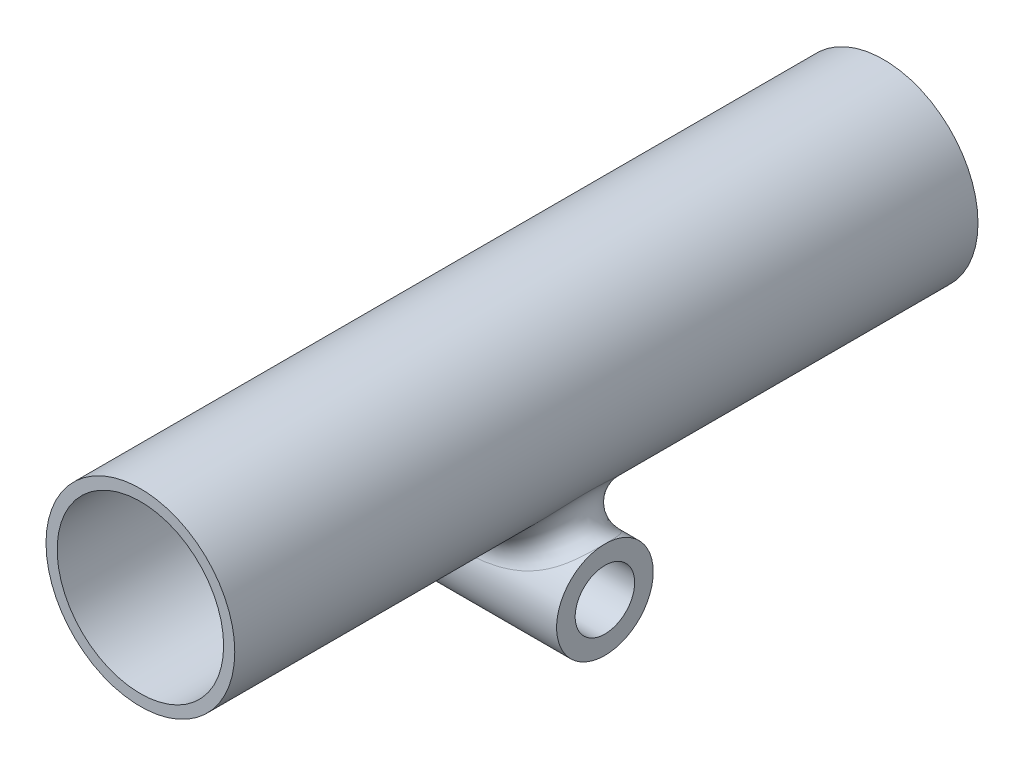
ISO-10303-21;
HEADER;
FILE_DESCRIPTION(('STEP AP214'),'2;1');
FILE_NAME('part.step','',(''),(''),'','','');
FILE_SCHEMA(('AUTOMOTIVE_DESIGN { 1 0 10303 214 1 1 1 1 }'));
ENDSEC;
DATA;
#1=APPLICATION_CONTEXT('core data for automotive mechanical design processes');
#2=APPLICATION_PROTOCOL_DEFINITION('international standard','automotive_design',2000,#1);
#3=PRODUCT_CONTEXT('',#1,'mechanical');
#4=PRODUCT('Part','Part','',(#3));
#5=PRODUCT_RELATED_PRODUCT_CATEGORY('part','',(#4));
#6=PRODUCT_DEFINITION_FORMATION('','',#4);
#7=PRODUCT_DEFINITION_CONTEXT('part definition',#1,'design');
#8=PRODUCT_DEFINITION('design','',#6,#7);
#9=PRODUCT_DEFINITION_SHAPE('','',#8);
#10=(LENGTH_UNIT() NAMED_UNIT(*) SI_UNIT(.MILLI.,.METRE.));
#11=(NAMED_UNIT(*) PLANE_ANGLE_UNIT() SI_UNIT($,.RADIAN.));
#12=(NAMED_UNIT(*) SI_UNIT($,.STERADIAN.) SOLID_ANGLE_UNIT());
#13=UNCERTAINTY_MEASURE_WITH_UNIT(LENGTH_MEASURE(1.E-05),#10,'distance_accuracy_value','');
#14=(GEOMETRIC_REPRESENTATION_CONTEXT(3) GLOBAL_UNCERTAINTY_ASSIGNED_CONTEXT((#13)) GLOBAL_UNIT_ASSIGNED_CONTEXT((#10,
#11,#12)) REPRESENTATION_CONTEXT('',''));
#15=CARTESIAN_POINT('',(0.,0.,0.));
#16=DIRECTION('',(0.,0.,1.));
#17=DIRECTION('',(1.,0.,0.));
#18=AXIS2_PLACEMENT_3D('',#15,#16,#17);
#19=CARTESIAN_POINT('',(0.,0.,100.));
#20=DIRECTION('',(0.,0.,-1.));
#21=DIRECTION('',(-1.,0.,0.));
#22=AXIS2_PLACEMENT_3D('',#19,#20,#21);
#23=CYLINDRICAL_SURFACE('',#22,12.7);
#24=CARTESIAN_POINT('',(-1.48760057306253,-12.6125748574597,58.8676385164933));
#25=CARTESIAN_POINT('',(-1.41720191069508,-12.6208780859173,57.2930018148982));
#26=CARTESIAN_POINT('',(-1.5293039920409,-13.9146660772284,56.3996645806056));
#27=CARTESIAN_POINT('',(-1.64140607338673,-15.2084540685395,55.5063273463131));
#28=CARTESIAN_POINT('',(-1.83900228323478,-16.6681580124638,56.067331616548));
#29=CARTESIAN_POINT('',(-1.17873981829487,-12.6490037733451,58.8849465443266));
#30=CARTESIAN_POINT('',(-1.12411061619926,-12.6536998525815,57.3133542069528));
#31=CARTESIAN_POINT('',(-1.21266974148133,-13.9443751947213,56.4192078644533));
#32=CARTESIAN_POINT('',(-1.30155697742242,-15.2350194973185,55.5250413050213));
#33=CARTESIAN_POINT('',(-1.457182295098,-16.6989708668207,56.0791739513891));
#34=CARTESIAN_POINT('',(-0.86833518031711,-12.6741027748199,58.8965164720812));
#35=CARTESIAN_POINT('',(-0.828364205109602,-12.6764874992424,57.3271178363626));
#36=CARTESIAN_POINT('',(-0.893618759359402,-13.9649923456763,56.4324413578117));
#37=CARTESIAN_POINT('',(-0.958997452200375,-15.2534929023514,55.5377620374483));
#38=CARTESIAN_POINT('',(-1.07345372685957,-16.7202004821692,56.0870902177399));
#39=CARTESIAN_POINT('',(-0.24638134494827,-12.7014249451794,58.9090934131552));
#40=CARTESIAN_POINT('',(-0.235262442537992,-12.7012847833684,57.3420768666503));
#41=CARTESIAN_POINT('',(-0.253714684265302,-13.9874431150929,56.4468352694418));
#42=CARTESIAN_POINT('',(-0.272292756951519,-15.2735969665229,55.5515908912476));
#43=CARTESIAN_POINT('',(-0.30458166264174,-16.7433105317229,56.0956954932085));
#44=CARTESIAN_POINT('',(0.0651678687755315,-12.7036477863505,58.9101002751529));
#45=CARTESIAN_POINT('',(0.0622861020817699,-12.7033103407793,57.34328188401));
#46=CARTESIAN_POINT('',(0.0671384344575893,-13.9892764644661,56.4479955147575));
#47=CARTESIAN_POINT('',(0.0720762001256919,-15.2752405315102,55.552707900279));
#48=CARTESIAN_POINT('',(0.0805618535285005,-16.7451906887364,56.0963843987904));
#49=CARTESIAN_POINT('',(0.68770584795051,-12.6851919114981,58.9016288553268));
#50=CARTESIAN_POINT('',(0.656174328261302,-12.6865499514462,57.3331960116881));
#51=CARTESIAN_POINT('',(0.707846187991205,-13.9741010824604,56.4382884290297));
#52=CARTESIAN_POINT('',(0.759601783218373,-15.2616502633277,55.5433795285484));
#53=CARTESIAN_POINT('',(0.850156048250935,-16.7295800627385,56.0905881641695));
#54=CARTESIAN_POINT('',(0.998694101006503,-12.6644979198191,58.8921435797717));
#55=CARTESIAN_POINT('',(0.952707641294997,-12.6677391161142,57.3218901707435));
#56=CARTESIAN_POINT('',(1.02770001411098,-13.9570797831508,56.4274130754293));
#57=CARTESIAN_POINT('',(1.10298274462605,-15.2463962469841,55.5329203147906));
#58=CARTESIAN_POINT('',(1.23460609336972,-16.7120763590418,56.0840982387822));
#59=CARTESIAN_POINT('',(1.61796527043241,-12.600360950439,58.8619219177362));
#60=CARTESIAN_POINT('',(1.54134972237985,-12.609818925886,57.2862331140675));
#61=CARTESIAN_POINT('',(1.66316292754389,-13.9046691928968,56.3931681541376));
#62=CARTESIAN_POINT('',(1.78526546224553,-15.1994958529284,55.5000876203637));
#63=CARTESIAN_POINT('',(2.0001617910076,-16.657827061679,56.0634202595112));
#64=CARTESIAN_POINT('',(1.9262481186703,-12.5569174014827,58.8411852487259));
#65=CARTESIAN_POINT('',(1.83364253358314,-12.5706720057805,57.2618582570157));
#66=CARTESIAN_POINT('',(1.97877190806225,-13.8692794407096,56.3697982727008));
#67=CARTESIAN_POINT('',(2.124381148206,-15.1678190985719,55.4776924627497));
#68=CARTESIAN_POINT('',(2.3812673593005,-16.6210809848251,56.0492320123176));
#69=CARTESIAN_POINT('',(2.56028521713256,-12.4437130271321,58.7849126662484));
#70=CARTESIAN_POINT('',(2.43173639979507,-12.4696498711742,57.1966695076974));
#71=CARTESIAN_POINT('',(2.62529902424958,-13.7779911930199,56.3074681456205));
#72=CARTESIAN_POINT('',(2.81941079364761,-15.0862549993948,55.4182133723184));
#73=CARTESIAN_POINT('',(3.16507700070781,-16.5253287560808,56.0107297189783));
#74=CARTESIAN_POINT('',(2.88568657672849,-12.3722731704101,58.7484131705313));
#75=CARTESIAN_POINT('',(2.7371388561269,-12.4062688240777,57.1547475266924));
#76=CARTESIAN_POINT('',(2.95566909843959,-13.7207923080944,56.2675008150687));
#77=CARTESIAN_POINT('',(3.17494623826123,-15.0351626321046,55.3801422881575));
#78=CARTESIAN_POINT('',(3.56734482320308,-16.4649024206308,55.9857563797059));
#79=CARTESIAN_POINT('',(3.52845876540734,-12.2045195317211,58.6576538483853));
#80=CARTESIAN_POINT('',(3.33565717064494,-12.2596215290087,57.0526240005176));
#81=CARTESIAN_POINT('',(3.60418926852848,-13.5885553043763,56.1705295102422));
#82=CARTESIAN_POINT('',(3.87346760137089,-14.9173377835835,55.2883235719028));
#83=CARTESIAN_POINT('',(4.36195296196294,-16.3230105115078,55.9236578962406));
#84=CARTESIAN_POINT('',(3.84582803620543,-12.1082009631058,58.6033906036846));
#85=CARTESIAN_POINT('',(3.62892545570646,-12.1762606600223,56.9923454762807));
#86=CARTESIAN_POINT('',(3.92233699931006,-13.5135137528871,56.113522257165));
#87=CARTESIAN_POINT('',(4.21663589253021,-14.8505301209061,55.2345086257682));
#88=CARTESIAN_POINT('',(4.75429135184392,-16.2415408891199,55.8865304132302));
#89=CARTESIAN_POINT('',(4.46897167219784,-11.892301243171,58.4731909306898));
#90=CARTESIAN_POINT('',(4.1988949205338,-11.9929722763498,56.8511966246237));
#91=CARTESIAN_POINT('',(4.54188679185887,-13.3487284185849,55.9807057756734));
#92=CARTESIAN_POINT('',(4.88576420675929,-14.7042497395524,55.1100252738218));
#93=CARTESIAN_POINT('',(5.52463427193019,-16.0589253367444,55.7974464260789));
#94=CARTESIAN_POINT('',(4.77476509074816,-11.772760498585,58.3972920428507));
#95=CARTESIAN_POINT('',(4.47571913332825,-11.892980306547,56.7702677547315));
#96=CARTESIAN_POINT('',(4.84331678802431,-13.2590102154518,55.9049291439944));
#97=CARTESIAN_POINT('',(5.21187121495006,-14.6247262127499,55.039306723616));
#98=CARTESIAN_POINT('',(5.90266235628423,-15.9578135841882,55.7455156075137));
#99=CARTESIAN_POINT('',(5.37189285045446,-11.5125424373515,58.2189028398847));
#100=CARTESIAN_POINT('',(5.00969423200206,-11.6804955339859,56.58521841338));
#101=CARTESIAN_POINT('',(5.42605411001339,-13.0686882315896,55.7326915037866));
#102=CARTESIAN_POINT('',(5.8433677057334,-14.4565708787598,54.8798837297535));
#103=CARTESIAN_POINT('',(6.64084391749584,-15.737712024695,55.6234598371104));
#104=CARTESIAN_POINT('',(5.66323521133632,-11.3718770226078,58.1164274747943));
#105=CARTESIAN_POINT('',(5.26687867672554,-11.5679339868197,56.481004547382));
#106=CARTESIAN_POINT('',(5.70737263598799,-12.9680905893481,55.6362421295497));
#107=CARTESIAN_POINT('',(6.14880382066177,-14.3678868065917,54.791104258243));
#108=CARTESIAN_POINT('',(7.00100730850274,-15.618732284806,55.5533451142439));
#109=CARTESIAN_POINT('',(6.13219172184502,-11.1234437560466,57.9195538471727));
#110=CARTESIAN_POINT('',(5.67509644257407,-11.3748486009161,56.2868266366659));
#111=CARTESIAN_POINT('',(6.15517886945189,-12.7957904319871,55.4576501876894));
#112=CARTESIAN_POINT('',(6.6356791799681,-14.21657132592,54.6283081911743));
#113=CARTESIAN_POINT('',(7.58074094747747,-15.4085987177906,55.4186421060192));
#114=CARTESIAN_POINT('',(6.31494138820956,-11.0206420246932,57.8341477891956));
#115=CARTESIAN_POINT('',(5.83275025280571,-11.2962770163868,56.203853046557));
#116=CARTESIAN_POINT('',(6.32832187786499,-12.7258236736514,55.3817032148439));
#117=CARTESIAN_POINT('',(6.82428495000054,-14.1552052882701,54.5593644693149));
#118=CARTESIAN_POINT('',(7.80665982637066,-15.321645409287,55.360206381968));
#119=CARTESIAN_POINT('',(6.67127099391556,-10.8086568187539,57.6477117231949));
#120=CARTESIAN_POINT('',(6.13739789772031,-11.1375028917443,56.0262573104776));
#121=CARTESIAN_POINT('',(6.66339497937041,-12.5846469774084,55.2199207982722));
#122=CARTESIAN_POINT('',(7.18978231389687,-14.0316267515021,54.4133957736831));
#123=CARTESIAN_POINT('',(8.24716177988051,-15.1423408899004,55.2326448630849));
#124=CARTESIAN_POINT('',(6.84485357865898,-10.6994752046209,57.5466862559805));
#125=CARTESIAN_POINT('',(6.28436525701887,-11.0572994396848,55.9316140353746));
#126=CARTESIAN_POINT('',(6.82532831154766,-12.513437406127,55.1340882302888));
#127=CARTESIAN_POINT('',(7.3666443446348,-13.9694144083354,54.3363564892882));
#128=CARTESIAN_POINT('',(8.46174812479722,-15.0499912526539,55.1635221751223));
#129=CARTESIAN_POINT('',(7.18152247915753,-10.4764728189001,57.3275746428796));
#130=CARTESIAN_POINT('',(6.56702883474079,-10.8969553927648,55.7303977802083));
#131=CARTESIAN_POINT('',(7.13718961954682,-12.3712722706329,54.9525089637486));
#132=CARTESIAN_POINT('',(7.70770476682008,-13.8454276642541,54.1744142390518));
#133=CARTESIAN_POINT('',(8.87794511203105,-14.8613680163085,55.0136037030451));
#134=CARTESIAN_POINT('',(7.34461566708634,-10.36265516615,57.209499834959));
#135=CARTESIAN_POINT('',(6.7026914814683,-10.8168236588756,55.6238166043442));
#136=CARTESIAN_POINT('',(7.28712547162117,-12.3003165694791,54.8567688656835));
#137=CARTESIAN_POINT('',(7.87186415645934,-13.7836607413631,54.0895074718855));
#138=CARTESIAN_POINT('',(9.07956424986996,-14.7650970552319,54.9328156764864));
#139=CARTESIAN_POINT('',(7.65918619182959,-10.1323669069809,56.9549758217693));
#140=CARTESIAN_POINT('',(6.96253671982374,-10.6581622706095,55.3985248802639));
#141=CARTESIAN_POINT('',(7.57460351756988,-12.1599833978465,54.6554102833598));
#142=CARTESIAN_POINT('',(8.18697616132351,-13.6616552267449,53.9120817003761));
#143=CARTESIAN_POINT('',(9.46844277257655,-14.5703111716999,54.7586676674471));
#144=CARTESIAN_POINT('',(7.81066322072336,-10.0158962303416,56.8185261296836));
#145=CARTESIAN_POINT('',(7.08666978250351,-10.5796512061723,55.2798096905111));
#146=CARTESIAN_POINT('',(7.71214538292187,-12.0906059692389,54.5497915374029));
#147=CARTESIAN_POINT('',(8.33787025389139,-13.6014315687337,53.8195632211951));
#148=CARTESIAN_POINT('',(9.65570177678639,-14.4717961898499,54.6653073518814));
#149=CARTESIAN_POINT('',(8.10224857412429,-9.78155920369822,56.5249314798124));
#150=CARTESIAN_POINT('',(7.32450451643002,-10.4249142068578,55.0290423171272));
#151=CARTESIAN_POINT('',(7.97582143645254,-11.9539633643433,54.327783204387));
#152=CARTESIAN_POINT('',(8.62739390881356,-13.482880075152,53.6263092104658));
#153=CARTESIAN_POINT('',(10.0161655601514,-14.2735857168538,54.4644268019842));
#154=CARTESIAN_POINT('',(8.24222872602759,-9.6636905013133,56.3675940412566));
#155=CARTESIAN_POINT('',(7.43803351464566,-10.3487467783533,54.89688115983));
#156=CARTESIAN_POINT('',(8.10182844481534,-11.8867260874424,54.2112968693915));
#157=CARTESIAN_POINT('',(8.76581846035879,-13.424598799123,53.5255143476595));
#158=CARTESIAN_POINT('',(10.1892118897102,-14.1738882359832,54.3567748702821));
#159=CARTESIAN_POINT('',(8.50804311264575,-9.43050739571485,56.0329528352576));
#160=CARTESIAN_POINT('',(7.6532649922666,-10.200809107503,54.6204172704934));
#161=CARTESIAN_POINT('',(8.34071904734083,-11.7561335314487,53.9687361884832));
#162=CARTESIAN_POINT('',(9.02836931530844,-13.3113506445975,53.3168560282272));
#163=CARTESIAN_POINT('',(10.5178170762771,-13.976653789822,54.1278098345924));
#164=CARTESIAN_POINT('',(8.6338770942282,-9.31519303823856,55.855648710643));
#165=CARTESIAN_POINT('',(7.7549137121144,-10.1290696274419,54.4761382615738));
#166=CARTESIAN_POINT('',(8.4536024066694,-11.692778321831,53.8426616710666));
#167=CARTESIAN_POINT('',(9.15243025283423,-13.2564072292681,53.209013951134));
#168=CARTESIAN_POINT('',(10.6733756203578,-13.8791168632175,54.0064964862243));
#169=CARTESIAN_POINT('',(8.87049002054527,-9.09016302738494,55.4815188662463));
#170=CARTESIAN_POINT('',(7.94639377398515,-9.99111068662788,54.1758616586));
#171=CARTESIAN_POINT('',(8.66611878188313,-11.5708465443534,53.5813054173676));
#172=CARTESIAN_POINT('',(9.38598354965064,-13.1505021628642,52.9865772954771));
#173=CARTESIAN_POINT('',(10.9658813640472,-13.6887785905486,53.7505129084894));
#174=CARTESIAN_POINT('',(8.98127704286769,-8.98044438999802,55.2847037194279));
#175=CARTESIAN_POINT('',(8.03618349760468,-9.92491889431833,54.0199059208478));
#176=CARTESIAN_POINT('',(8.76575890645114,-11.5122674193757,53.446028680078));
#177=CARTESIAN_POINT('',(9.49542502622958,-13.0995615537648,52.8720152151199));
#178=CARTESIAN_POINT('',(11.1028385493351,-13.5959747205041,53.6158499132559));
#179=CARTESIAN_POINT('',(9.18731836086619,-8.76954549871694,54.8725384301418));
#180=CARTESIAN_POINT('',(8.20401208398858,-9.7989715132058,53.6967149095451));
#181=CARTESIAN_POINT('',(8.95178771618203,-11.4006332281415,53.1665638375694));
#182=CARTESIAN_POINT('',(9.69965467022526,-13.0022400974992,52.6362755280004));
#183=CARTESIAN_POINT('',(11.3575510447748,-13.4175890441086,53.3338420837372));
#184=CARTESIAN_POINT('',(9.28257551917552,-8.66836367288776,54.6571917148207));
#185=CARTESIAN_POINT('',(8.28201385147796,-9.73924186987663,53.5295241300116));
#186=CARTESIAN_POINT('',(9.03817884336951,-11.3475771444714,53.0223773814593));
#187=CARTESIAN_POINT('',(9.79439741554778,-12.9558789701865,52.5151316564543));
#188=CARTESIAN_POINT('',(11.4753098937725,-13.3320059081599,53.1864995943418));
#189=CARTESIAN_POINT('',(9.44400267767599,-8.49192925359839,54.2438477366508));
#190=CARTESIAN_POINT('',(8.41516346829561,-9.63568940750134,53.2109266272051));
#191=CARTESIAN_POINT('',(9.18543784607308,-11.2553990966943,52.7482123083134));
#192=CARTESIAN_POINT('',(9.95575020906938,-12.8750849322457,52.2854266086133));
#193=CARTESIAN_POINT('',(11.6748694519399,-13.1827714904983,52.9036852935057));
#194=CARTESIAN_POINT('',(9.51239314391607,-8.41507539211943,54.0482111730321));
#195=CARTESIAN_POINT('',(8.47196899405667,-9.59083950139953,53.0610147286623));
#196=CARTESIAN_POINT('',(9.24818891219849,-11.2153859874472,52.6194192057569));
#197=CARTESIAN_POINT('',(10.0244305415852,-12.8399184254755,52.1777743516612));
#198=CARTESIAN_POINT('',(11.7594151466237,-13.117765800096,52.7698286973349));
#199=CARTESIAN_POINT('',(9.63787787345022,-8.2710601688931,53.6462456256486));
#200=CARTESIAN_POINT('',(8.57693991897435,-9.50698499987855,52.7542259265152));
#201=CARTESIAN_POINT('',(9.36399074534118,-11.1404280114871,52.3561816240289));
#202=CARTESIAN_POINT('',(10.1510633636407,-12.7738569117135,51.9580877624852));
#203=CARTESIAN_POINT('',(11.9145419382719,-12.9959526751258,52.4947996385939));
#204=CARTESIAN_POINT('',(9.69497320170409,-8.20389789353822,53.4399176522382));
#205=CARTESIAN_POINT('',(8.62509383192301,-9.46798928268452,52.5973735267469));
#206=CARTESIAN_POINT('',(9.41704242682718,-11.1054826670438,52.2217376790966));
#207=CARTESIAN_POINT('',(10.2090019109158,-12.7429688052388,51.8460711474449));
#208=CARTESIAN_POINT('',(11.9851243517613,-12.9391444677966,52.3536278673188));
#209=CARTESIAN_POINT('',(9.79797326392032,-8.08060511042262,53.0181991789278));
#210=CARTESIAN_POINT('',(8.71258603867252,-9.39642401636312,52.27752924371));
#211=CARTESIAN_POINT('',(9.51330777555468,-11.041228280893,51.9477983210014));
#212=CARTESIAN_POINT('',(10.3140402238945,-12.6860253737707,51.6180366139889));
#213=CARTESIAN_POINT('',(12.112455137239,-12.8348591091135,52.0650836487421));
#214=CARTESIAN_POINT('',(9.84387982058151,-8.02447280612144,52.8028101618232));
#215=CARTESIAN_POINT('',(8.75191809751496,-9.36385951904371,52.1145577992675));
#216=CARTESIAN_POINT('',(9.5565230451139,-11.0119183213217,51.8083037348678));
#217=CARTESIAN_POINT('',(10.3611324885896,-12.6599740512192,51.5020332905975));
#218=CARTESIAN_POINT('',(12.1692057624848,-12.7873804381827,51.9177122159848));
#219=CARTESIAN_POINT('',(9.92468795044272,-7.92431173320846,52.3647006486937));
#220=CARTESIAN_POINT('',(8.82159436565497,-9.30570449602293,51.7834529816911));
#221=CARTESIAN_POINT('',(9.63299207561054,-10.9594887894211,51.5250110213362));
#222=CARTESIAN_POINT('',(10.4443941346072,-12.6132700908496,51.2665526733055));
#223=CARTESIAN_POINT('',(12.2691024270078,-12.702660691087,51.6179530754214));
#224=CARTESIAN_POINT('',(9.95958988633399,-7.88028256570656,52.1419803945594));
#225=CARTESIAN_POINT('',(8.85193479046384,-9.2801170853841,51.6153336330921));
#226=CARTESIAN_POINT('',(9.66624616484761,-10.936369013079,51.3812130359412));
#227=CARTESIAN_POINT('',(10.4805589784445,-12.5926199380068,51.1470853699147));
#228=CARTESIAN_POINT('',(12.3122489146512,-12.6654192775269,51.4655655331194));
#229=CARTESIAN_POINT('',(10.0162733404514,-7.80808582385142,51.7086798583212));
#230=CARTESIAN_POINT('',(8.90145170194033,-9.23811182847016,51.2884056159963));
#231=CARTESIAN_POINT('',(9.72047237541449,-10.8983671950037,51.1016282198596));
#232=CARTESIAN_POINT('',(10.5394940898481,-12.55862182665,50.9148451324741));
#233=CARTESIAN_POINT('',(12.3823221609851,-12.6043527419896,51.1690967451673));
#234=CARTESIAN_POINT('',(10.0388655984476,-7.77894928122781,51.4985067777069));
#235=CARTESIAN_POINT('',(8.92131280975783,-9.22113574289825,51.1298990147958));
#236=CARTESIAN_POINT('',(9.742199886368,-10.8829834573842,50.9660908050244));
#237=CARTESIAN_POINT('',(10.5630872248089,-12.5448309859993,50.8022807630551));
#238=CARTESIAN_POINT('',(12.4102511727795,-12.579708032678,51.0252941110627));
#239=CARTESIAN_POINT('',(10.0749854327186,-7.73211118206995,51.0749698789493));
#240=CARTESIAN_POINT('',(8.95315928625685,-9.193822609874,50.810514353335));
#241=CARTESIAN_POINT('',(9.77702176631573,-10.8582139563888,50.6930018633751));
#242=CARTESIAN_POINT('',(10.6008844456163,-12.5226051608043,50.5754875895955));
#243=CARTESIAN_POINT('',(12.4549032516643,-12.54009072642,50.7355057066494));
#244=CARTESIAN_POINT('',(10.0885098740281,-7.71441358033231,50.8616049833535));
#245=CARTESIAN_POINT('',(8.96514152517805,-9.18348820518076,50.649638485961));
#246=CARTESIAN_POINT('',(9.79011314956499,-10.8488302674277,50.5554496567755));
#247=CARTESIAN_POINT('',(10.6150848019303,-12.5141723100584,50.4612603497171));
#248=CARTESIAN_POINT('',(12.4716224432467,-12.5251214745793,50.5895191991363));
#249=CARTESIAN_POINT('',(10.1065585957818,-7.69075469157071,50.433406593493));
#250=CARTESIAN_POINT('',(8.98114754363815,-9.16966825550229,50.3267816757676));
#251=CARTESIAN_POINT('',(9.80759793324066,-10.8362786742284,50.2794023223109));
#252=CARTESIAN_POINT('',(10.6340483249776,-12.5028890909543,50.232022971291));
#253=CARTESIAN_POINT('',(12.4939346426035,-12.5051099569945,50.2965413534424));
#254=CARTESIAN_POINT('',(10.1110877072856,-7.68478710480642,50.2185739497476));
#255=CARTESIAN_POINT('',(8.9851755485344,-9.16617907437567,50.1648020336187));
#256=CARTESIAN_POINT('',(9.81199600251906,-10.8331074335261,50.1409077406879));
#257=CARTESIAN_POINT('',(10.6388165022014,-12.5000357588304,50.1170137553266));
#258=CARTESIAN_POINT('',(12.4995336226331,-12.5000623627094,50.1495505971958));
#259=CARTESIAN_POINT('',(10.1111941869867,-7.68464082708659,49.7888777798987));
#260=CARTESIAN_POINT('',(8.98527225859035,-9.16609327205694,49.840816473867));
#261=CARTESIAN_POINT('',(9.81210127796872,-10.8330290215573,49.8638961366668));
#262=CARTESIAN_POINT('',(10.6389302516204,-12.4999648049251,49.8869755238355));
#263=CARTESIAN_POINT('',(12.4996652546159,-12.4999386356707,49.8555479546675));
#264=CARTESIAN_POINT('',(10.1067682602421,-7.69046647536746,49.5740142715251));
#265=CARTESIAN_POINT('',(8.98133803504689,-9.16949918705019,49.6788104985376));
#266=CARTESIAN_POINT('',(9.80780528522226,-10.8361241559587,49.7253791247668));
#267=CARTESIAN_POINT('',(10.6342723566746,-12.5027492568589,49.7719464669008));
#268=CARTESIAN_POINT('',(12.4941938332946,-12.5048661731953,49.7085360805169));
#269=CARTESIAN_POINT('',(10.0801871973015,-7.72534956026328,48.9362265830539));
#270=CARTESIAN_POINT('',(8.95775183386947,-9.18987765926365,49.1979350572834));
#271=CARTESIAN_POINT('',(9.78204218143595,-10.8546352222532,49.3142232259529));
#272=CARTESIAN_POINT('',(10.6063329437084,-12.5193924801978,49.4305149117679));
#273=CARTESIAN_POINT('',(12.4613337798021,-12.5343715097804,49.2721550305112));
#274=CARTESIAN_POINT('',(10.0449298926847,-7.77155075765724,48.5152467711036));
#275=CARTESIAN_POINT('',(8.92649433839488,-9.21685774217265,48.8805464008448));
#276=CARTESIAN_POINT('',(9.74789431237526,-10.8791379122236,49.0428471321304));
#277=CARTESIAN_POINT('',(10.5692967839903,-12.5414162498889,49.2051680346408));
#278=CARTESIAN_POINT('',(12.4177479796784,-12.5734501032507,48.9841162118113));
#279=CARTESIAN_POINT('',(9.93842617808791,-7.90727190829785,47.6916005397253));
#280=CARTESIAN_POINT('',(8.83344129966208,-9.29581472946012,48.2591226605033));
#281=CARTESIAN_POINT('',(9.64599299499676,-10.9505734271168,48.5114176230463));
#282=CARTESIAN_POINT('',(10.4585507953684,-12.6053279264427,48.7637372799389));
#283=CARTESIAN_POINT('',(12.2860859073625,-12.6882478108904,48.4205687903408));
#284=CARTESIAN_POINT('',(9.86718402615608,-7.9967867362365,47.2889319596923));
#285=CARTESIAN_POINT('',(8.7716591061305,-9.34778049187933,47.9551326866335));
#286=CARTESIAN_POINT('',(9.57824352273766,-10.9975035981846,48.2513628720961));
#287=CARTESIAN_POINT('',(10.3848569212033,-12.6472068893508,48.5476854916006));
#288=CARTESIAN_POINT('',(12.1980148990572,-12.7639625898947,48.1450587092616));
#289=CARTESIAN_POINT('',(9.6874488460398,-8.21359058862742,46.5123550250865));
#290=CARTESIAN_POINT('',(8.61851995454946,-9.47359548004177,47.3666829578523));
#291=CARTESIAN_POINT('',(9.40983483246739,-11.1105629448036,47.747502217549));
#292=CARTESIAN_POINT('',(10.2011819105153,-12.7475091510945,48.1284120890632));
#293=CARTESIAN_POINT('',(11.9758225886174,-12.9473428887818,47.6137165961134));
#294=CARTESIAN_POINT('',(9.57891594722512,-8.34092002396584,46.1384779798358));
#295=CARTESIAN_POINT('',(8.52717300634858,-9.54743476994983,47.0823560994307));
#296=CARTESIAN_POINT('',(9.30914039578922,-11.1767126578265,47.5037140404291));
#297=CARTESIAN_POINT('',(10.0912122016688,-12.8059238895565,47.9252843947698));
#298=CARTESIAN_POINT('',(11.8416519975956,-13.05504258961,47.3579059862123));
#299=CARTESIAN_POINT('',(9.32403535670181,-8.62488181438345,45.4295987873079));
#300=CARTESIAN_POINT('',(8.31587656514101,-9.71349873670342,46.5382150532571));
#301=CARTESIAN_POINT('',(9.07567299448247,-11.3247578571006,47.0360497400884));
#302=CARTESIAN_POINT('',(9.83557410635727,-12.9359510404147,47.5340908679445));
#303=CARTESIAN_POINT('',(11.5265633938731,-13.2952274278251,46.8728833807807));
#304=CARTESIAN_POINT('',(9.17768945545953,-8.78151278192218,45.0945948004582));
#305=CARTESIAN_POINT('',(8.19602376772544,-9.80565127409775,46.2785574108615));
#306=CARTESIAN_POINT('',(8.94290154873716,-11.4066525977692,46.8121726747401));
#307=CARTESIAN_POINT('',(9.69002373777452,-13.0075080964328,47.3461399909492));
#308=CARTESIAN_POINT('',(11.3456475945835,-13.4277113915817,46.6436701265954));
#309=CARTESIAN_POINT('',(8.84444980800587,-9.11716071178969,44.4632490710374));
#310=CARTESIAN_POINT('',(7.92514981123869,-10.0071594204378,45.7811278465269));
#311=CARTESIAN_POINT('',(8.64253186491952,-11.5851232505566,46.3814559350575));
#312=CARTESIAN_POINT('',(9.36016448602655,-13.1629388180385,46.9821417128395));
#313=CARTESIAN_POINT('',(10.9336899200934,-13.7116141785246,46.2116967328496));
#314=CARTESIAN_POINT('',(8.65675623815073,-9.29658460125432,44.1678867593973));
#315=CARTESIAN_POINT('',(7.7736757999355,-10.1167329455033,45.5440974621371));
#316=CARTESIAN_POINT('',(8.47424988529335,-11.6819755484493,46.1750827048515));
#317=CARTESIAN_POINT('',(9.17528817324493,-13.2469616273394,46.8065551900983));
#318=CARTESIAN_POINT('',(10.7016592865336,-13.8633771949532,46.0096067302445));
#319=CARTESIAN_POINT('',(8.24553237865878,-9.66317909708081,43.6271468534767));
#320=CARTESIAN_POINT('',(7.44090540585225,-10.3476734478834,45.1000255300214));
#321=CARTESIAN_POINT('',(8.1048744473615,-11.8858614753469,45.7861076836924));
#322=CARTESIAN_POINT('',(8.76929958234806,-13.4237980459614,46.4726717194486));
#323=CARTESIAN_POINT('',(10.1932959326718,-14.1734556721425,45.6396267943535));
#324=CARTESIAN_POINT('',(8.02199543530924,-9.85035113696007,43.3817785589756));
#325=CARTESIAN_POINT('',(7.25981297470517,-10.4689193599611,44.8930956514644));
#326=CARTESIAN_POINT('',(7.90377489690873,-11.9928969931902,45.6035103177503));
#327=CARTESIAN_POINT('',(8.54843578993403,-13.5165195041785,46.3144708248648));
#328=CARTESIAN_POINT('',(9.91695498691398,-14.3317723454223,45.4717432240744));
#329=CARTESIAN_POINT('',(7.52146974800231,-10.2384874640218,42.9191895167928));
#330=CARTESIAN_POINT('',(6.84979483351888,-10.7294325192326,44.4925984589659));
#331=CARTESIAN_POINT('',(7.44947280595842,-12.2230962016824,45.2475892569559));
#332=CARTESIAN_POINT('',(8.04996894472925,-13.7163463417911,46.0032229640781));
#333=CARTESIAN_POINT('',(9.29819488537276,-14.6600716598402,45.1552349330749));
#334=CARTESIAN_POINT('',(7.24146047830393,-10.4391447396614,42.7066055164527));
#335=CARTESIAN_POINT('',(6.61820742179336,-10.869255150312,44.3019478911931));
#336=CARTESIAN_POINT('',(7.19318504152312,-12.3468391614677,45.0766469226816));
#337=CARTESIAN_POINT('',(7.76925970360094,-13.8239292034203,45.8519624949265));
#338=CARTESIAN_POINT('',(8.95204169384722,-14.8297946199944,45.0097827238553));
#339=CARTESIAN_POINT('',(6.65018929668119,-10.8254283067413,42.3327112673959));
#340=CARTESIAN_POINT('',(6.12060807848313,-11.1485286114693,43.9569383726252));
#341=CARTESIAN_POINT('',(6.64441308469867,-12.5945379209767,44.7649153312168));
#342=CARTESIAN_POINT('',(7.16930154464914,-14.0400569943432,45.5735143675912));
#343=CARTESIAN_POINT('',(8.22110015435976,-15.1565268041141,44.7539603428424));
#344=CARTESIAN_POINT('',(6.33889284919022,-11.0110375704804,42.1714585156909));
#345=CARTESIAN_POINT('',(5.85476834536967,-11.2879389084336,43.8025273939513));
#346=CARTESIAN_POINT('',(6.35188880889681,-12.7184938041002,44.6241599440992));
#347=CARTESIAN_POINT('',(6.85025179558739,-14.1485669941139,45.4462995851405));
#348=CARTESIAN_POINT('',(7.83626911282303,-15.31352162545,44.6436295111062));
#349=CARTESIAN_POINT('',(5.77466659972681,-11.3145150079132,41.9279158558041));
#350=CARTESIAN_POINT('',(5.36424877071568,-11.522979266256,43.563083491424));
#351=CARTESIAN_POINT('',(5.81416339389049,-12.9279246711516,44.4044160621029));
#352=CARTESIAN_POINT('',(6.26477493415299,-14.3325969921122,45.2460339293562));
#353=CARTESIAN_POINT('',(7.13876107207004,-15.5702134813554,44.4769950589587));
#354=CARTESIAN_POINT('',(5.527149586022,-11.4375733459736,41.8359776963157));
#355=CARTESIAN_POINT('',(5.14664403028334,-11.6206284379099,43.4704225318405));
#356=CARTESIAN_POINT('',(5.57597126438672,-13.0151386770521,44.3188350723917));
#357=CARTESIAN_POINT('',(6.00600677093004,-14.4094081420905,45.1674715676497));
#358=CARTESIAN_POINT('',(6.83277547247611,-15.6743005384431,44.4140900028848));
#359=CARTESIAN_POINT('',(5.02083574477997,-11.6687029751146,41.6724962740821));
#360=CARTESIAN_POINT('',(4.69642320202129,-11.8074689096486,43.3026545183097));
#361=CARTESIAN_POINT('',(5.0841542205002,-13.182334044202,44.1631027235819));
#362=CARTESIAN_POINT('',(5.47258908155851,-14.556959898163,45.0237741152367));
#363=CARTESIAN_POINT('',(6.2068599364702,-15.8697980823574,44.3022342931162));
#364=CARTESIAN_POINT('',(4.76203404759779,-11.7767677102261,41.6009619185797));
#365=CARTESIAN_POINT('',(4.46379776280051,-11.8966997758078,43.2274877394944));
#366=CARTESIAN_POINT('',(4.83052262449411,-13.2623122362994,44.0929581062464));
#367=CARTESIAN_POINT('',(5.19792385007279,-14.6277302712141,44.9585917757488));
#368=CARTESIAN_POINT('',(5.88692398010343,-15.9612030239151,44.2532897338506));
#369=CARTESIAN_POINT('',(4.23536268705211,-11.976271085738,41.475108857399));
#370=CARTESIAN_POINT('',(3.98580066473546,-12.0638572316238,43.0931458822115));
#371=CARTESIAN_POINT('',(4.31023198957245,-13.4124009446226,43.9670273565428));
#372=CARTESIAN_POINT('',(4.63534015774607,-14.7607487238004,44.8410730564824));
#373=CARTESIAN_POINT('',(5.23584206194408,-16.1299499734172,44.1671797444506));
#374=CARTESIAN_POINT('',(3.96748945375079,-12.0677030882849,41.4207970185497));
#375=CARTESIAN_POINT('',(3.74038060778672,-12.1418353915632,43.0339141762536));
#376=CARTESIAN_POINT('',(4.04356780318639,-13.4825075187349,43.9112469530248));
#377=CARTESIAN_POINT('',(4.34736089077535,-14.8230368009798,44.7886896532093));
#378=CARTESIAN_POINT('',(4.90469168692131,-16.2072863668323,44.130019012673));
#379=CARTESIAN_POINT('',(3.42481591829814,-12.2327870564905,41.3266509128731));
#380=CARTESIAN_POINT('',(3.23934818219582,-12.2841734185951,42.9298756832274));
#381=CARTESIAN_POINT('',(3.49985489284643,-13.6106755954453,43.8128903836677));
#382=CARTESIAN_POINT('',(3.76096795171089,-14.9370348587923,44.6960144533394));
#383=CARTESIAN_POINT('',(4.23382755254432,-16.346920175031,44.0656032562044));
#384=CARTESIAN_POINT('',(3.1500175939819,-12.3064440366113,41.2868125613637));
#385=CARTESIAN_POINT('',(2.98366008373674,-12.34859618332,42.8850117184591));
#386=CARTESIAN_POINT('',(3.22280912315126,-13.6687404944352,43.7703104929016));
#387=CARTESIAN_POINT('',(3.46246190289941,-14.9887943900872,44.6556736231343));
#388=CARTESIAN_POINT('',(3.89411623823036,-16.4092218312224,44.038345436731));
#389=CARTESIAN_POINT('',(2.51686041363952,-12.4534614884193,41.2097773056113));
#390=CARTESIAN_POINT('',(2.39127133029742,-12.478116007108,42.7973995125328));
#391=CARTESIAN_POINT('',(2.58134856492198,-13.7856610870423,43.6868759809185));
#392=CARTESIAN_POINT('',(2.77224713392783,-15.0930546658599,44.5764607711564));
#393=CARTESIAN_POINT('',(3.1113943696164,-16.533574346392,43.9856371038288));
#394=CARTESIAN_POINT('',(2.15679562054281,-12.5208778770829,41.1764951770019));
#395=CARTESIAN_POINT('',(2.05166896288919,-12.5384195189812,42.7587131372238));
#396=CARTESIAN_POINT('',(2.21433239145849,-13.8401199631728,43.6498958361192));
#397=CARTESIAN_POINT('',(2.37753603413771,-15.1417599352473,44.5411197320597));
#398=CARTESIAN_POINT('',(2.66627490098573,-16.5905974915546,43.9628651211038));
#399=CARTESIAN_POINT('',(1.43168895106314,-12.6243558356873,41.1265134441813));
#400=CARTESIAN_POINT('',(1.36484865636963,-12.6313593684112,42.7002401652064));
#401=CARTESIAN_POINT('',(1.47240883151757,-13.9241692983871,43.5938520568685));
#402=CARTESIAN_POINT('',(1.58051448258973,-15.2169167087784,44.4875047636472));
#403=CARTESIAN_POINT('',(1.76988319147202,-16.6781227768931,43.9286670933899));
#404=CARTESIAN_POINT('',(1.06664992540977,-12.6604346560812,41.1098047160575));
#405=CARTESIAN_POINT('',(1.01735092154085,-12.66409127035,42.6803904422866));
#406=CARTESIAN_POINT('',(1.09750590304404,-13.9537734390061,43.5747785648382));
#407=CARTESIAN_POINT('',(1.17787685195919,-15.2434452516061,44.4691734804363));
#408=CARTESIAN_POINT('',(1.31861447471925,-16.7086395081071,43.9172348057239));
#409=CARTESIAN_POINT('',(0.375550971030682,-12.6986215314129,41.0921803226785));
#410=CARTESIAN_POINT('',(0.358562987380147,-12.6987321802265,42.6594457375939));
#411=CARTESIAN_POINT('',(0.386701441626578,-13.9851325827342,43.554630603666));
#412=CARTESIAN_POINT('',(0.415012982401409,-15.2715260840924,44.4498197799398));
#413=CARTESIAN_POINT('',(0.464263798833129,-16.7409393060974,43.9051760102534));
#414=CARTESIAN_POINT('',(0.0496967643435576,-12.7040770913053,41.0897075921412));
#415=CARTESIAN_POINT('',(0.0473543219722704,-12.7037028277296,42.6564870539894));
#416=CARTESIAN_POINT('',(0.0511264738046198,-13.989631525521,43.5517819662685));
#417=CARTESIAN_POINT('',(0.054829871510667,-15.2755592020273,44.4470774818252));
#418=CARTESIAN_POINT('',(0.061436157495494,-16.7455538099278,43.9034841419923));
#419=CARTESIAN_POINT('',(-0.601505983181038,-12.6899282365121,41.096193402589));
#420=CARTESIAN_POINT('',(-0.573972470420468,-12.6908499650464,42.6642125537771));
#421=CARTESIAN_POINT('',(-0.619164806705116,-13.9779939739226,43.5592180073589));
#422=CARTESIAN_POINT('',(-0.664424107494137,-15.2651366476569,44.4542243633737));
#423=CARTESIAN_POINT('',(-0.743594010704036,-16.7335862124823,43.9079218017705));
#424=CARTESIAN_POINT('',(-0.926854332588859,-12.6703159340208,41.1051555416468));
#425=CARTESIAN_POINT('',(-0.884313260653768,-12.6730100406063,42.6749065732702));
#426=CARTESIAN_POINT('',(-0.953880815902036,-13.9618509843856,43.5695068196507));
#427=CARTESIAN_POINT('',(-1.02375281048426,-15.2506676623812,44.4641226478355));
#428=CARTESIAN_POINT('',(-1.14579630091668,-16.7169974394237,43.9140537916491));
#429=CARTESIAN_POINT('',(-1.57553198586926,-12.606117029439,41.1353319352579));
#430=CARTESIAN_POINT('',(-1.5011175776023,-12.6150030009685,42.710540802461));
#431=CARTESIAN_POINT('',(-1.61970480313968,-13.9093587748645,43.6037366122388));
#432=CARTESIAN_POINT('',(-1.73859590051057,-15.2036908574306,44.4969481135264));
#433=CARTESIAN_POINT('',(-1.94770489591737,-16.6626957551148,43.934700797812));
#434=CARTESIAN_POINT('',(-1.89885422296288,-12.5614682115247,41.1565767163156));
#435=CARTESIAN_POINT('',(-1.80778186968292,-12.574739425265,42.7355420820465));
#436=CARTESIAN_POINT('',(-1.95080168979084,-13.8729592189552,43.6277116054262));
#437=CARTESIAN_POINT('',(-2.09434528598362,-15.1711050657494,44.519931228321));
#438=CARTESIAN_POINT('',(-2.34740246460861,-16.6249302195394,43.949236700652));
#439=CARTESIAN_POINT('',(-2.54031493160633,-12.447605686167,41.2131290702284));
#440=CARTESIAN_POINT('',(-2.41292664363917,-12.4731163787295,42.8010694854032));
#441=CARTESIAN_POINT('',(-2.60497057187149,-13.7811206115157,43.6903736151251));
#442=CARTESIAN_POINT('',(-2.79753692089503,-15.0890519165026,44.5797278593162));
#443=CARTESIAN_POINT('',(-3.14038932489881,-16.5286213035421,43.9879304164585));
#444=CARTESIAN_POINT('',(-2.85845386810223,-12.3783941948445,41.248435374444));
#445=CARTESIAN_POINT('',(-2.71159496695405,-12.4116913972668,42.8416407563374));
#446=CARTESIAN_POINT('',(-2.92804328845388,-13.7256832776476,43.7290593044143));
#447=CARTESIAN_POINT('',(-3.14519926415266,-15.039531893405,44.6165820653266));
#448=CARTESIAN_POINT('',(-3.53367919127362,-16.4700797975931,44.0120873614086));
#449=CARTESIAN_POINT('',(-3.49289780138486,-12.2147017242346,41.3366909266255));
#450=CARTESIAN_POINT('',(-3.30269162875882,-12.2684646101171,42.9410674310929));
#451=CARTESIAN_POINT('',(-3.56844680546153,-13.5965216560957,43.8234948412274));
#452=CARTESIAN_POINT('',(-3.83493467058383,-14.9244314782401,44.7060304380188));
#453=CARTESIAN_POINT('',(-4.31799177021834,-16.3316229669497,44.0724727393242));
#454=CARTESIAN_POINT('',(-3.80906092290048,-12.1197785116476,41.3899533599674));
#455=CARTESIAN_POINT('',(-3.59504422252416,-12.1862227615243,43.0003149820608));
#456=CARTESIAN_POINT('',(-3.88556202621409,-13.5224791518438,43.879546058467));
#457=CARTESIAN_POINT('',(-4.17695478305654,-14.8585040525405,44.7589625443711));
#458=CARTESIAN_POINT('',(-4.70883909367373,-16.2513335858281,44.1089154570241));
#459=CARTESIAN_POINT('',(-4.43064127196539,-11.9066092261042,41.5178922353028));
#460=CARTESIAN_POINT('',(-4.16404792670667,-12.0050069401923,43.1392412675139));
#461=CARTESIAN_POINT('',(-4.50397184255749,-13.359535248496,44.0103238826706));
#462=CARTESIAN_POINT('',(-4.84477099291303,-14.7138338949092,44.8815912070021));
#463=CARTESIAN_POINT('',(-5.47724944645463,-16.0710275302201,44.1964525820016));
#464=CARTESIAN_POINT('',(-4.73605626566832,-11.7883583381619,41.5925730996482));
#465=CARTESIAN_POINT('',(-4.44079137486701,-11.9059373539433,43.2190164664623));
#466=CARTESIAN_POINT('',(-4.80526315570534,-13.2706307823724,44.0850543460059));
#467=CARTESIAN_POINT('',(-5.17068217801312,-14.6350164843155,44.9513690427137));
#468=CARTESIAN_POINT('',(-5.85480971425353,-15.9710067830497,44.2475500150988));
#469=CARTESIAN_POINT('',(-5.33183028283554,-11.5311112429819,41.7678800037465));
#470=CARTESIAN_POINT('',(-4.97413311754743,-11.6954725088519,43.4012411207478));
#471=CARTESIAN_POINT('',(-5.38719913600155,-13.0820845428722,44.2547492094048));
#472=CARTESIAN_POINT('',(-5.80120895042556,-14.4683916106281,45.1085319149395));
#473=CARTESIAN_POINT('',(-6.59131775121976,-15.7534181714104,44.3674968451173));
#474=CARTESIAN_POINT('',(-5.62223380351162,-11.3921817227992,41.8684233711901));
#475=CARTESIAN_POINT('',(-5.23081963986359,-11.5840406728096,43.5037232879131));
#476=CARTESIAN_POINT('',(-5.66790599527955,-12.9824775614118,44.3496489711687));
#477=CARTESIAN_POINT('',(-6.10592906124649,-14.3805552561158,45.1959449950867));
#478=CARTESIAN_POINT('',(-6.95032052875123,-15.6359067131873,44.4362896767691));
#479=CARTESIAN_POINT('',(-6.18517900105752,-11.0965933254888,42.1009149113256));
#480=CARTESIAN_POINT('',(-5.72178326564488,-11.3535877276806,43.7337559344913));
#481=CARTESIAN_POINT('',(-6.20604744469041,-12.7769068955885,44.5612322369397));
#482=CARTESIAN_POINT('',(-6.69124729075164,-14.1998700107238,45.3890743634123));
#483=CARTESIAN_POINT('',(-7.64624490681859,-15.3858876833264,44.5953628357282));
#484=CARTESIAN_POINT('',(-6.45773369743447,-10.939947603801,42.2328398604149));
#485=CARTESIAN_POINT('',(-5.95602744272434,-11.2345322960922,43.861388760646));
#486=CARTESIAN_POINT('',(-6.46349905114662,-12.6709479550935,44.6778996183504));
#487=CARTESIAN_POINT('',(-6.9718132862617,-14.1069967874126,45.4948522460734));
#488=CARTESIAN_POINT('',(-7.98318260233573,-15.2533912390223,44.6856272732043));
#489=CARTESIAN_POINT('',(-6.88187506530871,-10.6755160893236,42.4765069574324));
#490=CARTESIAN_POINT('',(-6.31558354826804,-11.0399544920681,44.0897624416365));
#491=CARTESIAN_POINT('',(-6.85975344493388,-12.4980408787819,44.8852431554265));
#492=CARTESIAN_POINT('',(-7.40425556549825,-13.9559817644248,45.680897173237));
#493=CARTESIAN_POINT('',(-8.5075148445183,-15.0297257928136,44.8523468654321));
#494=CARTESIAN_POINT('',(-7.04020695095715,-10.5716736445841,42.5769936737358));
#495=CARTESIAN_POINT('',(-6.44868199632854,-10.9649317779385,44.1825174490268));
#496=CARTESIAN_POINT('',(-7.00658672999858,-12.4315043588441,44.969047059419));
#497=CARTESIAN_POINT('',(-7.56478615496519,-13.8979389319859,45.7557601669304));
#498=CARTESIAN_POINT('',(-8.70324796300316,-14.9418922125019,44.9211009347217));
#499=CARTESIAN_POINT('',(-7.34739643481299,-10.3605232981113,42.79330114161));
#500=CARTESIAN_POINT('',(-6.70499814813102,-10.8154216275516,44.3785247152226));
#501=CARTESIAN_POINT('',(-7.28967925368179,-12.2990697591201,45.1453129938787));
#502=CARTESIAN_POINT('',(-7.8746538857,-13.7825807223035,45.9122840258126));
#503=CARTESIAN_POINT('',(-9.08300189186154,-14.7632938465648,45.0691007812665));
#504=CARTESIAN_POINT('',(-7.49625696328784,-10.2532164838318,42.9091171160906));
#505=CARTESIAN_POINT('',(-6.82818279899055,-10.7409442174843,44.4817836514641));
#506=CARTESIAN_POINT('',(-7.4259417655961,-12.2331714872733,45.2377723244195));
#507=CARTESIAN_POINT('',(-8.02395239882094,-13.7252736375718,45.9939474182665));
#508=CARTESIAN_POINT('',(-9.26702632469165,-14.672529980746,45.1483432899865));
#509=CARTESIAN_POINT('',(-7.78345088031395,-10.0369419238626,43.1569698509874));
#510=CARTESIAN_POINT('',(-7.06442065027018,-10.5938167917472,44.6988277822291));
#511=CARTESIAN_POINT('',(-7.6874854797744,-12.1031148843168,45.4312098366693));
#512=CARTESIAN_POINT('',(-8.31080326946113,-13.6122871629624,46.1637786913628));
#513=CARTESIAN_POINT('',(-9.62206132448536,-14.4895973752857,45.3179267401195));
#514=CARTESIAN_POINT('',(-7.92178938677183,-9.9279750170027,43.2889986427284));
#515=CARTESIAN_POINT('',(-7.17743756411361,-10.5211829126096,44.812608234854));
#516=CARTESIAN_POINT('',(-7.81277202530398,-12.0389557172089,45.5321838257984));
#517=CARTESIAN_POINT('',(-8.44831236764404,-13.5566204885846,46.2519403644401));
#518=CARTESIAN_POINT('',(-9.79307821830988,-14.3974293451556,45.408262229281));
#519=CARTESIAN_POINT('',(-8.18708569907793,-9.7103585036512,43.5699291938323));
#520=CARTESIAN_POINT('',(-7.3933512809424,-10.3788374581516,45.0506796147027));
#521=CARTESIAN_POINT('',(-8.05223264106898,-11.9132803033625,45.7425092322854));
#522=CARTESIAN_POINT('',(-8.71132063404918,-13.4476146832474,46.4345202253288));
#523=CARTESIAN_POINT('',(-10.1210429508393,-14.2133616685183,45.6004778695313));
#524=CARTESIAN_POINT('',(-8.31404312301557,-9.60170890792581,43.7188315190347));
#525=CARTESIAN_POINT('',(-7.49620454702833,-10.3091479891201,45.174960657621));
#526=CARTESIAN_POINT('',(-8.16640633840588,-11.8517641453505,45.8518609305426));
#527=CARTESIAN_POINT('',(-8.83676732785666,-13.3942926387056,46.5289276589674));
#528=CARTESIAN_POINT('',(-10.2779903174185,-14.1214620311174,45.7023584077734));
#529=CARTESIAN_POINT('',(-8.55667914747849,-9.38614857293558,44.0348854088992));
#530=CARTESIAN_POINT('',(-7.69256322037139,-10.1731553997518,45.434848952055));
#531=CARTESIAN_POINT('',(-8.38436398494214,-11.7317075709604,46.0795846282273));
#532=CARTESIAN_POINT('',(-9.07632721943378,-13.2901702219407,46.7244899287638));
#533=CARTESIAN_POINT('',(-10.5779419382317,-13.9391335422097,45.918605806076));
#534=CARTESIAN_POINT('',(-8.67226370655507,-9.2792575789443,44.2021682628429));
#535=CARTESIAN_POINT('',(-7.78594710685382,-10.1069080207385,45.5705134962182));
#536=CARTESIAN_POINT('',(-8.4880614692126,-11.6731936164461,46.1980194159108));
#537=CARTESIAN_POINT('',(-9.19029281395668,-13.2394118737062,46.8256715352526));
#538=CARTESIAN_POINT('',(-10.7208299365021,-13.8487213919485,46.0330624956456));
#539=CARTESIAN_POINT('',(-8.89038613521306,-9.0704925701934,44.5537016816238));
#540=CARTESIAN_POINT('',(-7.96251183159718,-9.97923925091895,45.8520493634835));
#541=CARTESIAN_POINT('',(-8.68401207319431,-11.5603368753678,46.4429172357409));
#542=CARTESIAN_POINT('',(-9.40562986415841,-13.1413667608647,47.0339320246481));
#543=CARTESIAN_POINT('',(-10.9904773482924,-13.6721406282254,46.2735853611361));
#544=CARTESIAN_POINT('',(-8.99292380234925,-8.96861863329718,44.7379525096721));
#545=CARTESIAN_POINT('',(-8.04565418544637,-9.91784259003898,45.9978914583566));
#546=CARTESIAN_POINT('',(-8.77626501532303,-11.505994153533,46.569380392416));
#547=CARTESIAN_POINT('',(-9.50695420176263,-13.0940987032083,47.1409872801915));
#548=CARTESIAN_POINT('',(-11.1172365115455,-13.585972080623,46.3996517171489));
#549=CARTESIAN_POINT('',(-9.18450450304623,-8.7723255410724,45.122504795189));
#550=CARTESIAN_POINT('',(-8.20172529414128,-9.80065518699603,46.2993429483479));
#551=CARTESIAN_POINT('',(-8.94925700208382,-11.4021190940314,46.830025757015));
#552=CARTESIAN_POINT('',(-9.69686733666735,-13.0035357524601,47.3608271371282));
#553=CARTESIAN_POINT('',(-11.3540724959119,-13.419940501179,46.6627664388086));
#554=CARTESIAN_POINT('',(-9.27354994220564,-8.67790505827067,45.3228033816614));
#555=CARTESIAN_POINT('',(-8.27462423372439,-9.74488532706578,46.4549162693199));
#556=CARTESIAN_POINT('',(-9.02999809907,-11.3525858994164,46.9642065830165));
#557=CARTESIAN_POINT('',(-9.78541962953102,-12.9602567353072,47.4735844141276));
#558=CARTESIAN_POINT('',(-11.4641522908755,-13.340076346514,46.7998128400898));
#559=CARTESIAN_POINT('',(-9.43796603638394,-8.4987992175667,45.738084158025));
#560=CARTESIAN_POINT('',(-8.41013948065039,-9.63968367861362,46.7752678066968));
#561=CARTESIAN_POINT('',(-9.17988653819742,-11.2589681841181,47.23992736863));
#562=CARTESIAN_POINT('',(-9.94968143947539,-12.8782227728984,47.704675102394));
#563=CARTESIAN_POINT('',(-11.6674068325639,-13.1885823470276,47.0839523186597));
#564=CARTESIAN_POINT('',(-9.51333835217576,-8.41411267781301,45.9530645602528));
#565=CARTESIAN_POINT('',(-8.47273318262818,-9.59026859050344,46.9400098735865));
#566=CARTESIAN_POINT('',(-9.24903528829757,-11.2148830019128,47.381466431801));
#567=CARTESIAN_POINT('',(-10.02536336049,-12.8394806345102,47.8229818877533));
#568=CARTESIAN_POINT('',(-11.7605836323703,-13.1169515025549,47.2310441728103));
#569=CARTESIAN_POINT('',(-9.64210570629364,-8.26608881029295,46.3690069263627));
#570=CARTESIAN_POINT('',(-8.58050345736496,-9.50409971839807,47.2573684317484));
#571=CARTESIAN_POINT('',(-9.36791769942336,-11.1378423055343,47.6537578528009));
#572=CARTESIAN_POINT('',(-10.1553515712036,-12.7715721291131,48.0501927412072));
#573=CARTESIAN_POINT('',(-11.9197684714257,-12.9917477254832,47.5156363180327));
#574=CARTESIAN_POINT('',(-9.69705756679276,-8.20140787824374,46.5685063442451));
#575=CARTESIAN_POINT('',(-8.62686231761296,-9.4665443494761,47.4090159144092));
#576=CARTESIAN_POINT('',(-9.41898896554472,-11.1041854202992,47.783736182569));
#577=CARTESIAN_POINT('',(-10.2111256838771,-12.7418197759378,48.1584850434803));
#578=CARTESIAN_POINT('',(-11.9877010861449,-12.9370383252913,47.6521359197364));
#579=CARTESIAN_POINT('',(-9.79654612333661,-8.08230837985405,46.9760684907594));
#580=CARTESIAN_POINT('',(-8.7113751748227,-9.39741282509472,47.7181203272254));
#581=CARTESIAN_POINT('',(-9.51197550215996,-11.0421155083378,48.0484762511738));
#582=CARTESIAN_POINT('',(-10.3125858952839,-12.6868114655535,48.3788609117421));
#583=CARTESIAN_POINT('',(-12.1106908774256,-12.8362997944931,47.9309942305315));
#584=CARTESIAN_POINT('',(-9.84107921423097,-8.02789336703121,47.1841341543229));
#585=CARTESIAN_POINT('',(-8.74951941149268,-9.36584424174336,47.8755617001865));
#586=CARTESIAN_POINT('',(-9.55388760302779,-11.0137042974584,48.1832396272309));
#587=CARTESIAN_POINT('',(-10.3582601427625,-12.661561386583,48.4909331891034));
#588=CARTESIAN_POINT('',(-12.1657435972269,-12.7902736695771,48.0733549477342));
#589=CARTESIAN_POINT('',(-9.91983685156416,-7.93037083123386,47.6070690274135));
#590=CARTESIAN_POINT('',(-8.81739668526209,-9.30922385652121,48.195223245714));
#591=CARTESIAN_POINT('',(-9.62838797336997,-10.9626646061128,48.4567477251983));
#592=CARTESIAN_POINT('',(-10.4393834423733,-12.6161024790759,48.7182878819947));
#593=CARTESIAN_POINT('',(-12.263105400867,-12.7077856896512,48.3627314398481));
#594=CARTESIAN_POINT('',(-9.95406700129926,-7.88725716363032,47.8219344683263));
#595=CARTESIAN_POINT('',(-8.84713053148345,-9.28417159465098,48.357428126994));
#596=CARTESIAN_POINT('',(-9.66098131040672,-10.9400329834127,48.595490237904));
#597=CARTESIAN_POINT('',(-10.4748335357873,-12.5958933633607,48.8335595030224));
#598=CARTESIAN_POINT('',(-12.3054214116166,-12.6713186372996,48.5097446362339));
#599=CARTESIAN_POINT('',(-10.0124247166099,-7.81303609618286,48.2568910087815));
#600=CARTESIAN_POINT('',(-8.89807322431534,-9.24099475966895,48.6856272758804));
#601=CARTESIAN_POINT('',(-9.71677548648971,-10.9009787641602,48.8761670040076));
#602=CARTESIAN_POINT('',(-10.5354790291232,-12.5609618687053,49.0667132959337));
#603=CARTESIAN_POINT('',(-12.3775644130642,-12.6085398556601,48.807346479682));
#604=CARTESIAN_POINT('',(-10.0365485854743,-7.78193308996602,48.4769839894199));
#605=CARTESIAN_POINT('',(-8.91927729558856,-9.2228741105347,48.8516151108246));
#606=CARTESIAN_POINT('',(-9.73997288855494,-10.8845584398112,49.0181024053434));
#607=CARTESIAN_POINT('',(-10.5606687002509,-12.5462426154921,49.1845908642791));
#608=CARTESIAN_POINT('',(-12.4073868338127,-12.5822318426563,48.95793641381));
#609=CARTESIAN_POINT('',(-10.0920045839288,-7.71008034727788,49.1197918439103));
#610=CARTESIAN_POINT('',(-8.96815155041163,-9.18097824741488,49.3363640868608));
#611=CARTESIAN_POINT('',(-9.79341676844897,-10.8465688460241,49.4325838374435));
#612=CARTESIAN_POINT('',(-10.6186830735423,-12.5121586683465,49.5288130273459));
#613=CARTESIAN_POINT('',(-12.4759426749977,-12.5214562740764,49.3977523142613));
#614=CARTESIAN_POINT('',(-10.1104182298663,-7.68566999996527,49.5473082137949));
#615=CARTESIAN_POINT('',(-8.98458079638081,-9.16669397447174,49.6586890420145));
#616=CARTESIAN_POINT('',(-9.81134633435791,-10.8335753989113,49.7081744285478));
#617=CARTESIAN_POINT('',(-10.6381122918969,-12.5004565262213,49.7576650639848));
#618=CARTESIAN_POINT('',(-12.4987060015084,-12.5008091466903,49.6902635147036));
#619=CARTESIAN_POINT('',(-10.1118234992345,-7.68381078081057,50.4023126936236));
#620=CARTESIAN_POINT('',(-8.98583131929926,-9.16560926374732,50.3033258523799));
#621=CARTESIAN_POINT('',(-9.81271197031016,-10.8325891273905,50.2593478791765));
#622=CARTESIAN_POINT('',(-10.6395922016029,-12.4995692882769,50.2153645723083));
#623=CARTESIAN_POINT('',(-12.5004432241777,-12.4992365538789,50.2752665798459));
#624=CARTESIAN_POINT('',(-10.0948198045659,-7.70635570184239,50.8298007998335));
#625=CARTESIAN_POINT('',(-8.97065678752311,-9.1788051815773,50.6256421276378));
#626=CARTESIAN_POINT('',(-9.79615259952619,-10.8445929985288,50.5349307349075));
#627=CARTESIAN_POINT('',(-10.6216478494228,-12.5103812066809,50.4442151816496));
#628=CARTESIAN_POINT('',(-12.4794229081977,-12.5183058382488,50.5677584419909));
#629=CARTESIAN_POINT('',(-10.0251607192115,-7.79675315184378,51.6707182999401));
#630=CARTESIAN_POINT('',(-8.90922133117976,-9.23151552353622,51.2597495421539));
#631=CARTESIAN_POINT('',(-9.72897935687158,-10.8923988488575,51.0771206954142));
#632=CARTESIAN_POINT('',(-10.5487395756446,-12.553280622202,50.8944828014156));
#633=CARTESIAN_POINT('',(-12.3933089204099,-12.5947671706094,51.1431230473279));
#634=CARTESIAN_POINT('',(-9.97268256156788,-7.86438042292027,52.0842069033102));
#635=CARTESIAN_POINT('',(-8.8631176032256,-9.27089683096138,51.571565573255));
#636=CARTESIAN_POINT('',(-9.67853478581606,-10.9280825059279,51.343765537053));
#637=CARTESIAN_POINT('',(-10.4939628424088,-12.5852604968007,51.1159172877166));
#638=CARTESIAN_POINT('',(-12.3284343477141,-12.6519686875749,51.4260363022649));
#639=CARTESIAN_POINT('',(-9.83117680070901,-8.04056077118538,52.8875399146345));
#640=CARTESIAN_POINT('',(-8.74086442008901,-9.37320169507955,52.1784829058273));
#641=CARTESIAN_POINT('',(-9.54440620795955,-11.0203653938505,51.8629919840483));
#642=CARTESIAN_POINT('',(-10.3479624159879,-12.6675193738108,51.5474513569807));
#643=CARTESIAN_POINT('',(-12.1535020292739,-12.800988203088,51.9756852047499));
#644=CARTESIAN_POINT('',(-9.74215397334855,-8.14910850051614,53.2773874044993));
#645=CARTESIAN_POINT('',(-8.66474086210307,-9.43610409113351,52.473508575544));
#646=CARTESIAN_POINT('',(-9.46072654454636,-11.0769618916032,52.1155754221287));
#647=CARTESIAN_POINT('',(-10.2567698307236,-12.7177815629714,51.7574969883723));
#648=CARTESIAN_POINT('',(-12.043450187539,-12.89280167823,52.2424229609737));
#649=CARTESIAN_POINT('',(-9.52622340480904,-8.40050274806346,54.0241334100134));
#650=CARTESIAN_POINT('',(-8.48323932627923,-9.58226190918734,53.0420939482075));
#651=CARTESIAN_POINT('',(-9.26066357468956,-11.2077979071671,52.6031090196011));
#652=CARTESIAN_POINT('',(-10.0381480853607,-12.8332949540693,52.1639821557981));
#653=CARTESIAN_POINT('',(-11.7765123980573,-13.1054397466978,52.7533544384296));
#654=CARTESIAN_POINT('',(-9.39919997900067,-8.54345373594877,54.380926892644));
#655=CARTESIAN_POINT('',(-8.37783771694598,-9.66552838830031,53.315446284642));
#656=CARTESIAN_POINT('',(-9.1441804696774,-11.2820911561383,52.8380025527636));
#657=CARTESIAN_POINT('',(-9.91068797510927,-12.8985521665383,52.3602777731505));
#658=CARTESIAN_POINT('',(-11.6194834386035,-13.2263527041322,52.9974762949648));
#659=CARTESIAN_POINT('',(-9.10737659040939,-8.85386282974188,55.0519027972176));
#660=CARTESIAN_POINT('',(-8.13857127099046,-9.84889360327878,53.8360834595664));
#661=CARTESIAN_POINT('',(-8.87928695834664,-11.4449884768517,53.286852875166));
#662=CARTESIAN_POINT('',(-9.6201650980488,-13.0409838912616,52.7373489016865));
#663=CARTESIAN_POINT('',(-11.2587253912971,-13.4889075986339,53.4565650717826));
#664=CARTESIAN_POINT('',(-8.94257727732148,-9.02132051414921,55.3660859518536));
#665=CARTESIAN_POINT('',(-8.00483241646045,-9.94890202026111,54.0832042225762));
#666=CARTESIAN_POINT('',(-8.73087710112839,-11.5335923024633,53.5008100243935));
#667=CARTESIAN_POINT('',(-9.45725660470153,-13.1180896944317,52.9180013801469));
#668=CARTESIAN_POINT('',(-11.0549971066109,-13.6305491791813,53.6715324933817));
#669=CARTESIAN_POINT('',(-8.57084280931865,-9.37542313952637,55.9567557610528));
#670=CARTESIAN_POINT('',(-7.70398479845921,-10.1658667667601,54.5570088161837));
#671=CARTESIAN_POINT('',(-8.39697497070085,-11.7253668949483,53.9131507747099));
#672=CARTESIAN_POINT('',(-9.09031702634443,-13.2846655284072,53.2688591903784));
#673=CARTESIAN_POINT('',(-10.5954513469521,-13.9300615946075,54.0756749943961));
#674=CARTESIAN_POINT('',(-8.3626963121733,-9.56251898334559,56.231655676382));
#675=CARTESIAN_POINT('',(-7.53610484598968,-10.2831560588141,54.7826182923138));
#676=CARTESIAN_POINT('',(-8.21042031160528,-11.8289219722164,54.110787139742));
#677=CARTESIAN_POINT('',(-8.88533210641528,-13.3743708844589,53.4384159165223));
#678=CARTESIAN_POINT('',(-10.3381363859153,-14.088313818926,54.263764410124));
#679=CARTESIAN_POINT('',(-7.91149605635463,-9.93903640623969,56.7305395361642));
#680=CARTESIAN_POINT('',(-7.16946083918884,-10.5275191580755,55.2026041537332));
#681=CARTESIAN_POINT('',(-7.80369686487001,-12.0446414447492,54.4811608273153));
#682=CARTESIAN_POINT('',(-8.43851502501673,-13.561455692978,53.759184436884));
#683=CARTESIAN_POINT('',(-9.78035339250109,-14.4067854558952,54.6051059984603));
#684=CARTESIAN_POINT('',(-7.66842538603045,-10.1284590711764,56.9544986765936));
#685=CARTESIAN_POINT('',(-6.97090791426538,-10.6544782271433,55.3968989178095));
#686=CARTESIAN_POINT('',(-7.58351178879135,-12.1568099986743,54.6538860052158));
#687=CARTESIAN_POINT('',(-8.19693825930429,-13.6587468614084,53.910320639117));
#688=CARTESIAN_POINT('',(-9.47986445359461,-14.5670057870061,54.7583411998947));
#689=CARTESIAN_POINT('',(-7.23453660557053,-10.4402459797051,57.2912139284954));
#690=CARTESIAN_POINT('',(-6.6112711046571,-10.8711602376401,55.6971897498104));
#691=CARTESIAN_POINT('',(-7.18604121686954,-12.3484350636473,54.9226249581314));
#692=CARTESIAN_POINT('',(-7.76119660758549,-13.8255230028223,54.1477971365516));
#693=CARTESIAN_POINT('',(-8.94348226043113,-14.8307260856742,54.9887253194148));
#694=CARTESIAN_POINT('',(-7.05159995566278,-10.564822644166,57.4167100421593));
#695=CARTESIAN_POINT('',(-6.45849369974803,-10.9598111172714,55.8115429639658));
#696=CARTESIAN_POINT('',(-7.01730133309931,-12.426982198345,55.025592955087));
#697=CARTESIAN_POINT('',(-7.57655580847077,-13.8939538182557,54.2393965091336));
#698=CARTESIAN_POINT('',(-8.71733222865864,-14.9360973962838,55.0745910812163));
#699=CARTESIAN_POINT('',(-6.67347546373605,-10.8076433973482,57.6474398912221));
#700=CARTESIAN_POINT('',(-6.13935251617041,-11.1365802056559,56.0257548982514));
#701=CARTESIAN_POINT('',(-6.66551080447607,-12.5838378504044,55.2194453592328));
#702=CARTESIAN_POINT('',(-7.19211322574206,-14.0308976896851,54.4128912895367));
#703=CARTESIAN_POINT('',(-8.24988699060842,-15.1414837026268,55.2324588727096));
#704=CARTESIAN_POINT('',(-6.47828405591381,-10.9258856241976,57.7526676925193));
#705=CARTESIAN_POINT('',(-5.97303591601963,-11.2246902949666,56.1256347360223));
#706=CARTESIAN_POINT('',(-6.48245599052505,-12.6621462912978,55.3103262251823));
#707=CARTESIAN_POINT('',(-6.99236557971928,-14.0994033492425,54.4947992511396));
#708=CARTESIAN_POINT('',(-8.00858737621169,-15.2414971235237,55.3044568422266));
#709=CARTESIAN_POINT('',(-6.07706098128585,-11.1540444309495,57.9450117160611));
#710=CARTESIAN_POINT('',(-5.62744968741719,-11.3982325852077,56.3114955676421));
#711=CARTESIAN_POINT('',(-6.10284299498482,-12.8166382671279,55.4802570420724));
#712=CARTESIAN_POINT('',(-6.57872592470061,-14.2348444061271,54.64879867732));
#713=CARTESIAN_POINT('',(-7.51258719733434,-15.4344818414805,55.4360606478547));
#714=CARTESIAN_POINT('',(-5.87101221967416,-11.2639471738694,58.0320982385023));
#715=CARTESIAN_POINT('',(-5.44819164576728,-11.4836677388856,56.3974902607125));
#716=CARTESIAN_POINT('',(-5.90626336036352,-12.8928181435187,55.5592875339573));
#717=CARTESIAN_POINT('',(-6.36484648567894,-14.3017816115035,54.7208998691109));
#718=CARTESIAN_POINT('',(-7.25786549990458,-15.5274414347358,55.495646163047));
#719=CARTESIAN_POINT('',(-5.44989285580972,-11.4736232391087,58.1901456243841));
#720=CARTESIAN_POINT('',(-5.07805596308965,-11.6495812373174,56.5561709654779));
#721=CARTESIAN_POINT('',(-5.50110782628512,-13.0410049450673,55.7057788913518));
#722=CARTESIAN_POINT('',(-5.92467124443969,-14.4322414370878,54.8552018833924));
#723=CARTESIAN_POINT('',(-6.73726912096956,-15.704792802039,55.6037838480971));
#724=CARTESIAN_POINT('',(-5.23482025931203,-11.5733943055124,58.2611029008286));
#725=CARTESIAN_POINT('',(-4.88718727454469,-11.7300789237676,56.6288951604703));
#726=CARTESIAN_POINT('',(-5.29252927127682,-13.1130109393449,55.7732371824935));
#727=CARTESIAN_POINT('',(-5.69838286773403,-14.4957781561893,54.9174318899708));
#728=CARTESIAN_POINT('',(-6.47139197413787,-15.7891826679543,55.6523335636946));
#729=CARTESIAN_POINT('',(-4.73953286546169,-11.7863184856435,58.4058073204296));
#730=CARTESIAN_POINT('',(-4.44370837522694,-11.9043840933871,56.7794027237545));
#731=CARTESIAN_POINT('',(-4.80854059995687,-13.269223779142,55.9134717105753));
#732=CARTESIAN_POINT('',(-5.17418102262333,-14.6338021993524,55.0473053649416));
#733=CARTESIAN_POINT('',(-5.85910755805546,-15.9692814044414,55.7513418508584));
#734=CARTESIAN_POINT('',(-4.45706094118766,-11.8960908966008,58.4753809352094));
#735=CARTESIAN_POINT('',(-4.18786773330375,-11.9962476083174,56.8536206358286));
#736=CARTESIAN_POINT('',(-4.52997998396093,-13.3516594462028,55.9829812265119));
#737=CARTESIAN_POINT('',(-4.87284645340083,-14.7068707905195,55.1121795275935));
#738=CARTESIAN_POINT('',(-5.50990998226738,-16.0621307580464,55.7989448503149));
#739=CARTESIAN_POINT('',(-3.8826492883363,-12.0957667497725,58.5959834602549));
#740=CARTESIAN_POINT('',(-3.66261380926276,-12.1656861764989,56.9842962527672));
#741=CARTESIAN_POINT('',(-3.95900808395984,-13.5039862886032,56.1059266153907));
#742=CARTESIAN_POINT('',(-4.25615841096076,-14.8420839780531,55.2273940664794));
#743=CARTESIAN_POINT('',(-4.79981053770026,-16.2310235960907,55.8814623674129));
#744=CARTESIAN_POINT('',(-3.5907072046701,-12.1856652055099,58.647007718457));
#745=CARTESIAN_POINT('',(-3.39312378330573,-12.2433305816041,57.0408235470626));
#746=CARTESIAN_POINT('',(-3.66659334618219,-13.5738743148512,56.1593584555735));
#747=CARTESIAN_POINT('',(-3.94071025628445,-14.9042827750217,55.27779311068));
#748=CARTESIAN_POINT('',(-4.4389057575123,-16.3070628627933,55.9163737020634));
#749=CARTESIAN_POINT('',(-2.99964061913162,-12.3444655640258,58.7336999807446));
#750=CARTESIAN_POINT('',(-2.84353590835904,-12.3818331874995,57.1380696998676));
#751=CARTESIAN_POINT('',(-3.07093996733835,-13.6987367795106,56.2516292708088));
#752=CARTESIAN_POINT('',(-3.29899147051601,-15.0155042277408,55.3650885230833));
#753=CARTESIAN_POINT('',(-3.70821714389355,-16.4413817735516,55.9756894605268));
#754=CARTESIAN_POINT('',(-2.70051414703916,-12.4133616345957,58.7693637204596));
#755=CARTESIAN_POINT('',(-2.56331765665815,-12.4427585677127,57.1788433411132));
#756=CARTESIAN_POINT('',(-2.76769834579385,-13.7537070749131,56.2904641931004));
#757=CARTESIAN_POINT('',(-2.972577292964,-15.0645802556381,55.4020327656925));
#758=CARTESIAN_POINT('',(-3.33843087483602,-16.4996564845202,56.0000909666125));
#759=CARTESIAN_POINT('',(-2.09729559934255,-12.5293932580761,58.8277698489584));
#760=CARTESIAN_POINT('',(-1.99537548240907,-12.5459959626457,57.246208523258));
#761=CARTESIAN_POINT('',(-2.15352750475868,-13.8469733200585,56.3548128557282));
#762=CARTESIAN_POINT('',(-2.31217882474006,-15.1478745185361,55.4633649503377));
#763=CARTESIAN_POINT('',(-2.59271975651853,-16.5978000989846,56.0400530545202));
#764=CARTESIAN_POINT('',(-1.79320383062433,-12.5765301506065,58.8505130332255));
#765=CARTESIAN_POINT('',(-1.70750054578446,-12.5883690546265,57.2728433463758));
#766=CARTESIAN_POINT('',(-1.84259875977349,-13.8852702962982,56.380327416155));
#767=CARTESIAN_POINT('',(-1.97801698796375,-15.1821417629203,55.487791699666));
#768=CARTESIAN_POINT('',(-2.2167952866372,-16.6376701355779,56.0556141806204));
#769=CARTESIAN_POINT('',(-1.48760057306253,-12.6125748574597,58.8676385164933));
#770=CARTESIAN_POINT('',(-1.41720191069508,-12.6208780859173,57.2930018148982));
#771=CARTESIAN_POINT('',(-1.5293039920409,-13.9146660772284,56.3996645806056));
#772=CARTESIAN_POINT('',(-1.64140607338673,-15.2084540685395,55.5063273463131));
#773=CARTESIAN_POINT('',(-1.83900228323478,-16.6681580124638,56.067331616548));
#774=(BOUNDED_SURFACE() B_SPLINE_SURFACE(3,2,((#24,#25,#26,#27,#28),(#29,#30,#31,#32,#33),(#34,
#35,#36,#37,#38),(#39,#40,#41,#42,#43),(#44,#45,#46,#47,#48),(#49,#50,#51,#52,#53),(#54,#55,#56,
#57,#58),(#59,#60,#61,#62,#63),(#64,#65,#66,#67,#68),(#69,#70,#71,#72,#73),(#74,#75,#76,#77,
#78),(#79,#80,#81,#82,#83),(#84,#85,#86,#87,#88),(#89,#90,#91,#92,#93),(#94,#95,#96,#97,#98),
(#99,#100,#101,#102,#103),(#104,#105,#106,#107,#108),(#109,#110,#111,#112,#113),(#114,#115,#116,
#117,#118),(#119,#120,#121,#122,#123),(#124,#125,#126,#127,#128),(#129,#130,#131,#132,#133),
(#134,#135,#136,#137,#138),(#139,#140,#141,#142,#143),(#144,#145,#146,#147,#148),(#149,#150,
#151,#152,#153),(#154,#155,#156,#157,#158),(#159,#160,#161,#162,#163),(#164,#165,#166,#167,
#168),(#169,#170,#171,#172,#173),(#174,#175,#176,#177,#178),(#179,#180,#181,#182,#183),(#184,
#185,#186,#187,#188),(#189,#190,#191,#192,#193),(#194,#195,#196,#197,#198),(#199,#200,#201,#202,
#203),(#204,#205,#206,#207,#208),(#209,#210,#211,#212,#213),(#214,#215,#216,#217,#218),(#219,
#220,#221,#222,#223),(#224,#225,#226,#227,#228),(#229,#230,#231,#232,#233),(#234,#235,#236,#237,
#238),(#239,#240,#241,#242,#243),(#244,#245,#246,#247,#248),(#249,#250,#251,#252,#253),(#254,
#255,#256,#257,#258),(#259,#260,#261,#262,#263),(#264,#265,#266,#267,#268),(#269,#270,#271,#272,
#273),(#274,#275,#276,#277,#278),(#279,#280,#281,#282,#283),(#284,#285,#286,#287,#288),(#289,
#290,#291,#292,#293),(#294,#295,#296,#297,#298),(#299,#300,#301,#302,#303),(#304,#305,#306,#307,
#308),(#309,#310,#311,#312,#313),(#314,#315,#316,#317,#318),(#319,#320,#321,#322,#323),(#324,
#325,#326,#327,#328),(#329,#330,#331,#332,#333),(#334,#335,#336,#337,#338),(#339,#340,#341,#342,
#343),(#344,#345,#346,#347,#348),(#349,#350,#351,#352,#353),(#354,#355,#356,#357,#358),(#359,
#360,#361,#362,#363),(#364,#365,#366,#367,#368),(#369,#370,#371,#372,#373),(#374,#375,#376,#377,
#378),(#379,#380,#381,#382,#383),(#384,#385,#386,#387,#388),(#389,#390,#391,#392,#393),(#394,
#395,#396,#397,#398),(#399,#400,#401,#402,#403),(#404,#405,#406,#407,#408),(#409,#410,#411,#412,
#413),(#414,#415,#416,#417,#418),(#419,#420,#421,#422,#423),(#424,#425,#426,#427,#428),(#429,
#430,#431,#432,#433),(#434,#435,#436,#437,#438),(#439,#440,#441,#442,#443),(#444,#445,#446,#447,
#448),(#449,#450,#451,#452,#453),(#454,#455,#456,#457,#458),(#459,#460,#461,#462,#463),(#464,
#465,#466,#467,#468),(#469,#470,#471,#472,#473),(#474,#475,#476,#477,#478),(#479,#480,#481,#482,
#483),(#484,#485,#486,#487,#488),(#489,#490,#491,#492,#493),(#494,#495,#496,#497,#498),(#499,
#500,#501,#502,#503),(#504,#505,#506,#507,#508),(#509,#510,#511,#512,#513),(#514,#515,#516,#517,
#518),(#519,#520,#521,#522,#523),(#524,#525,#526,#527,#528),(#529,#530,#531,#532,#533),(#534,
#535,#536,#537,#538),(#539,#540,#541,#542,#543),(#544,#545,#546,#547,#548),(#549,#550,#551,#552,
#553),(#554,#555,#556,#557,#558),(#559,#560,#561,#562,#563),(#564,#565,#566,#567,#568),(#569,
#570,#571,#572,#573),(#574,#575,#576,#577,#578),(#579,#580,#581,#582,#583),(#584,#585,#586,#587,
#588),(#589,#590,#591,#592,#593),(#594,#595,#596,#597,#598),(#599,#600,#601,#602,#603),(#604,
#605,#606,#607,#608),(#609,#610,#611,#612,#613),(#614,#615,#616,#617,#618),(#619,#620,#621,#622,
#623),(#624,#625,#626,#627,#628),(#629,#630,#631,#632,#633),(#634,#635,#636,#637,#638),(#639,
#640,#641,#642,#643),(#644,#645,#646,#647,#648),(#649,#650,#651,#652,#653),(#654,#655,#656,#657,
#658),(#659,#660,#661,#662,#663),(#664,#665,#666,#667,#668),(#669,#670,#671,#672,#673),(#674,
#675,#676,#677,#678),(#679,#680,#681,#682,#683),(#684,#685,#686,#687,#688),(#689,#690,#691,#692,
#693),(#694,#695,#696,#697,#698),(#699,#700,#701,#702,#703),(#704,#705,#706,#707,#708),(#709,
#710,#711,#712,#713),(#714,#715,#716,#717,#718),(#719,#720,#721,#722,#723),(#724,#725,#726,#727,
#728),(#729,#730,#731,#732,#733),(#734,#735,#736,#737,#738),(#739,#740,#741,#742,#743),(#744,
#745,#746,#747,#748),(#749,#750,#751,#752,#753),(#754,#755,#756,#757,#758),(#759,#760,#761,#762,
#763),(#764,#765,#766,#767,#768),(#769,#770,#771,#772,#773)),.UNSPECIFIED.,.T.,.F.,
.F.) B_SPLINE_SURFACE_WITH_KNOTS((4,2,2,2,2,2,2,2,2,2,2,2,2,2,2,2,2,2,2,2,2,2,2,2,2,2,2,2,2,2,2,
2,2,2,2,2,2,2,2,2,2,2,2,2,2,2,2,2,2,2,2,2,2,2,2,2,2,2,2,2,2,2,2,2,2,2,2,2,2,2,2,2,2,2,4),(3,2,
3),(0.,1.15426799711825,2.30855252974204,3.46360693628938,4.61869034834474,5.85748147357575,
7.09651111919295,8.33340384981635,9.56960229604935,10.3876613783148,11.2054830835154,
12.022763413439,12.8400654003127,13.6655028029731,14.4909549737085,15.3159622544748,
16.140817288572,16.8399103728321,17.5389375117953,18.2378507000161,18.9367408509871,
19.5811457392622,20.2257732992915,20.8700545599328,21.5145729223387,22.7891695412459,
24.063615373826,25.3394280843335,26.6151803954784,27.918201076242,29.2214639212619,
30.6440994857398,32.0683230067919,33.128601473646,34.1893420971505,35.2505051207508,
36.3113684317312,37.6714704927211,39.0308233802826,40.2381727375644,41.4459020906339,
42.6566460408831,43.867280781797,45.1002288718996,46.3334317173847,47.5627404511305,
48.7911422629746,49.5546748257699,50.3179700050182,51.0808915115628,51.8438386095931,
52.6126412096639,53.3814557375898,54.1501330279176,54.9187168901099,55.5940750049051,
56.2696664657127,56.9448898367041,57.6203599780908,58.9012399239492,60.1819505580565,
61.4563094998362,62.7305019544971,64.0086135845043,65.2867032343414,66.606983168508,
67.9279046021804,68.8298399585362,69.7320389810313,70.6357036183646,71.5395690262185,
72.6811306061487,73.8229782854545,74.9651427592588,76.1072369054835),(0.,0.5,1.),
.UNSPECIFIED.) GEOMETRIC_REPRESENTATION_ITEM() RATIONAL_B_SPLINE_SURFACE(((1.,0.885248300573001,
1.,0.885248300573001,1.),(1.,0.885706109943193,1.,0.885706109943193,1.),(1.,0.886024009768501,
1.,0.886024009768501,1.),(1.,0.886370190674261,1.,0.886370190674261,1.),(1.,0.886398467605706,
1.,0.886398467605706,1.),(1.,0.886164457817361,1.,0.886164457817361,1.),(1.,0.885901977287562,
1.,0.885901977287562,1.),(1.,0.885094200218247,1.,0.885094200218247,1.),(1.,0.884548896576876,
1.,0.884548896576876,1.),(1.,0.883143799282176,1.,0.883143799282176,1.),(1.,0.882264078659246,
1.,0.882264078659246,1.),(1.,0.88023511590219,1.,0.88023511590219,1.),(1.,0.879085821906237,1.,
0.879085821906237,1.),(1.,0.876573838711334,1.,0.876573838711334,1.),(1.,0.875211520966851,1.,
0.875211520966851,1.),(1.,0.872346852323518,1.,0.872346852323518,1.),(1.,0.870844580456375,1.,
0.870844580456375,1.),(1.,0.868312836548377,1.,0.868312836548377,1.),(1.,0.867295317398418,1.,
0.867295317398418,1.),(1.,0.865274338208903,1.,0.865274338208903,1.),(1.,0.864270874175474,1.,
0.864270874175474,1.),(1.,0.862312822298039,1.,0.862312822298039,1.),(1.,0.861358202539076,1.,
0.861358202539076,1.),(1.,0.859530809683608,1.,0.859530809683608,1.),(1.,0.858658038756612,1.,
0.858658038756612,1.),(1.,0.857015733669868,1.,0.857015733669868,1.),(1.,0.856247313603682,1.,
0.856247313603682,1.),(1.,0.854845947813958,1.,0.854845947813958,1.),(1.,0.854213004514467,1.,
0.854213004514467,1.),(1.,0.853092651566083,1.,0.853092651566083,1.),(1.,0.85260516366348,1.,
0.85260516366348,1.),(1.,0.8517712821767,1.,0.8517712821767,1.),(1.,0.851424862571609,1.,
0.851424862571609,1.),(1.,0.850899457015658,1.,0.850899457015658,1.),(1.,0.850702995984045,1.,
0.850702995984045,1.),(1.,0.850383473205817,1.,0.850383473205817,1.),(1.,0.850260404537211,1.,
0.850260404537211,1.),(1.,0.850069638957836,1.,0.850069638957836,1.),(1.,0.850001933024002,1.,
0.850001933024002,1.),(1.,0.849903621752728,1.,0.849903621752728,1.),(1.,0.84987301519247,1.,
0.84987301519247,1.),(1.,0.84983433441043,1.,0.84983433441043,1.),(1.,0.849824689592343,1.,
0.849824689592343,1.),(1.,0.849813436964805,1.,0.849813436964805,1.),(1.,0.849811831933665,1.,
0.849811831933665,1.),(1.,0.849810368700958,1.,0.849810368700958,1.),(1.,0.849810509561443,1.,
0.849810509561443,1.),(1.,0.849810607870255,1.,0.849810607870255,1.),(1.,0.849810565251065,1.,
0.849810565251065,1.),(1.,0.84981208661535,1.,0.84981208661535,1.),(1.,0.849815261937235,1.,
0.849815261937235,1.),(1.,0.849887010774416,1.,0.849887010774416,1.),(1.,0.849955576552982,1.,
0.849955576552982,1.),(1.,0.850264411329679,1.,0.850264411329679,1.),(1.,0.850504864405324,1.,
0.850504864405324,1.),(1.,0.851266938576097,1.,0.851266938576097,1.),(1.,0.851788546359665,1.,
0.851788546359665,1.),(1.,0.853193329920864,1.,0.853193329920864,1.),(1.,0.854083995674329,1.,
0.854083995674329,1.),(1.,0.856214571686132,1.,0.856214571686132,1.),(1.,0.857454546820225,1.,
0.857454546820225,1.),(1.,0.860318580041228,1.,0.860318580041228,1.),(1.,0.861967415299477,1.,
0.861967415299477,1.),(1.,0.865399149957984,1.,0.865399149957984,1.),(1.,0.867182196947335,1.,
0.867182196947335,1.),(1.,0.870251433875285,1.,0.870251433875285,1.),(1.,0.871548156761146,1.,
0.871548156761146,1.),(1.,0.874054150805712,1.,0.874054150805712,1.),(1.,0.875263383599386,1.,
0.875263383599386,1.),(1.,0.877542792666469,1.,0.877542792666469,1.),(1.,0.878612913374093,1.,
0.878612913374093,1.),(1.,0.880574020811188,1.,0.880574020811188,1.),(1.,0.881465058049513,1.,
0.881465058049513,1.),(1.,0.883261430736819,1.,0.883261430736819,1.),(1.,0.88409990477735,1.,
0.88409990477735,1.),(1.,0.88539460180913,1.,0.88539460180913,1.),(1.,0.885851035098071,1.,
0.885851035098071,1.),(1.,0.886334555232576,1.,0.886334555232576,1.),(1.,0.886403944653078,1.,
0.886403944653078,1.),(1.,0.886224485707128,1.,0.886224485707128,1.),(1.,0.88597553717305,1.,
0.88597553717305,1.),(1.,0.885166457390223,1.,0.885166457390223,1.),(1.,0.884605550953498,1.,
0.884605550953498,1.),(1.,0.883191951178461,1.,0.883191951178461,1.),(1.,0.882339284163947,1.,
0.882339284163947,1.),(1.,0.880357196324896,1.,0.880357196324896,1.),(1.,0.879222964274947,1.,
0.879222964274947,1.),(1.,0.876738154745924,1.,0.876738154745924,1.),(1.,0.875387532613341,1.,
0.875387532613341,1.),(1.,0.872547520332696,1.,0.872547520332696,1.),(1.,0.871058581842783,1.,
0.871058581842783,1.),(1.,0.868033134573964,1.,0.868033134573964,1.),(1.,0.866496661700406,1.,
0.866496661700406,1.),(1.,0.864057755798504,1.,0.864057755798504,1.),(1.,0.863135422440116,1.,
0.863135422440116,1.),(1.,0.861343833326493,1.,0.861343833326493,1.),(1.,0.860474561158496,1.,
0.860474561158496,1.),(1.,0.858815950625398,1.,0.858815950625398,1.),(1.,0.858026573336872,1.,
0.858026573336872,1.),(1.,0.856549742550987,1.,0.856549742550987,1.),(1.,0.855862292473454,1.,
0.855862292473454,1.),(1.,0.854600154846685,1.,0.854600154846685,1.),(1.,0.854026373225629,1.,
0.854026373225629,1.),(1.,0.85300480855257,1.,0.85300480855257,1.),(1.,0.852557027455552,1.,
0.852557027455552,1.),(1.,0.851783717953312,1.,0.851783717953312,1.),(1.,0.851458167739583,1.,
0.851458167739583,1.),(1.,0.850915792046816,1.,0.850915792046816,1.),(1.,0.850698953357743,1.,
0.850698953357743,1.),(1.,0.850374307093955,1.,0.850374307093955,1.),(1.,0.850256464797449,1.,
0.850256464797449,1.),(1.,0.850072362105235,1.,0.850072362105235,1.),(1.,0.850006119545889,1.,
0.850006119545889,1.),(1.,0.84990881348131,1.,0.84990881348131,1.),(1.,0.849877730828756,1.,
0.849877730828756,1.),(1.,0.849836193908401,1.,0.849836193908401,1.),(1.,0.849825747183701,1.,
0.849825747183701,1.),(1.,0.849807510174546,1.,0.849807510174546,1.),(1.,0.849810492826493,1.,
0.849810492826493,1.),(1.,0.849810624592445,1.,0.849810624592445,1.),(1.,0.849807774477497,1.,
0.849807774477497,1.),(1.,0.849828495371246,1.,0.849828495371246,1.),(1.,0.849851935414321,1.,
0.849851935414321,1.),(1.,0.850012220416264,1.,0.850012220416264,1.),(1.,0.850149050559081,1.,
0.850149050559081,1.),(1.,0.850650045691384,1.,0.850650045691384,1.),(1.,0.851014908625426,1.,
0.851014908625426,1.),(1.,0.852066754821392,1.,0.852066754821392,1.),(1.,0.852753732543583,1.,
0.852753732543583,1.),(1.,0.854509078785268,1.,0.854509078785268,1.),(1.,0.855589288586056,1.,
0.855589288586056,1.),(1.,0.858071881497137,1.,0.858071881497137,1.),(1.,0.859474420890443,1.,
0.859474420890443,1.),(1.,0.86200070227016,1.,0.86200070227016,1.),(1.,0.863071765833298,1.,
0.863071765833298,1.),(1.,0.865260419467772,1.,0.865260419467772,1.),(1.,0.866378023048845,1.,
0.866378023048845,1.),(1.,0.868615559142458,1.,0.868615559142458,1.),(1.,0.869735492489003,1.,
0.869735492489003,1.),(1.,0.871934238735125,1.,0.871934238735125,1.),(1.,0.873013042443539,1.,
0.873013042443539,1.),(1.,0.875366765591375,1.,0.875366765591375,1.),(1.,0.876618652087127,1.,
0.876618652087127,1.),(1.,0.87894045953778,1.,0.87894045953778,1.),(1.,0.880010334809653,1.,
0.880010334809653,1.),(1.,0.881925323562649,1.,0.881925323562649,1.),(1.,0.882770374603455,1.,
0.882770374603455,1.),(1.,0.884205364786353,1.,0.884205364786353,1.),(1.,0.884795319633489,1.,
0.884795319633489,1.),(1.,0.885248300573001,1.,0.885248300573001,1.))) REPRESENTATION_ITEM('') SURFACE());
#775=CARTESIAN_POINT('',(-1.48760057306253,-12.6125748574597,58.8676385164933));
#776=CARTESIAN_POINT('',(-1.17873981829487,-12.6490037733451,58.8849465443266));
#777=CARTESIAN_POINT('',(-0.868335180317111,-12.6741027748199,58.8965164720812));
#778=CARTESIAN_POINT('',(-0.246381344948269,-12.7014249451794,58.9090934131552));
#779=CARTESIAN_POINT('',(0.0651678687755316,-12.7036477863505,58.9101002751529));
#780=CARTESIAN_POINT('',(0.68770584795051,-12.6851919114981,58.9016288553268));
#781=CARTESIAN_POINT('',(0.998694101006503,-12.6644979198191,58.8921435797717));
#782=CARTESIAN_POINT('',(1.61796527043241,-12.600360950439,58.8619219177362));
#783=CARTESIAN_POINT('',(1.9262481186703,-12.5569174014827,58.8411852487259));
#784=CARTESIAN_POINT('',(2.56028521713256,-12.4437130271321,58.7849126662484));
#785=CARTESIAN_POINT('',(2.88568657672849,-12.3722731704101,58.7484131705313));
#786=CARTESIAN_POINT('',(3.52845876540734,-12.2045195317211,58.6576538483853));
#787=CARTESIAN_POINT('',(3.84582803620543,-12.1082009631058,58.6033906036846));
#788=CARTESIAN_POINT('',(4.46897167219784,-11.892301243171,58.4731909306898));
#789=CARTESIAN_POINT('',(4.77476509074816,-11.772760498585,58.3972920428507));
#790=CARTESIAN_POINT('',(5.37189285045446,-11.5125424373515,58.2189028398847));
#791=CARTESIAN_POINT('',(5.66323521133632,-11.3718770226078,58.1164274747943));
#792=CARTESIAN_POINT('',(6.13219172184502,-11.1234437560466,57.9195538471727));
#793=CARTESIAN_POINT('',(6.31494138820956,-11.0206420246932,57.8341477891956));
#794=CARTESIAN_POINT('',(6.67127099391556,-10.8086568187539,57.6477117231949));
#795=CARTESIAN_POINT('',(6.84485357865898,-10.6994752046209,57.5466862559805));
#796=CARTESIAN_POINT('',(7.18152247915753,-10.4764728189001,57.3275746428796));
#797=CARTESIAN_POINT('',(7.34461566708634,-10.36265516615,57.209499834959));
#798=CARTESIAN_POINT('',(7.65918619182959,-10.1323669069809,56.9549758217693));
#799=CARTESIAN_POINT('',(7.81066322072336,-10.0158962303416,56.8185261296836));
#800=CARTESIAN_POINT('',(8.10224857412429,-9.78155920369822,56.5249314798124));
#801=CARTESIAN_POINT('',(8.24222872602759,-9.6636905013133,56.3675940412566));
#802=CARTESIAN_POINT('',(8.50804311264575,-9.43050739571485,56.0329528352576));
#803=CARTESIAN_POINT('',(8.6338770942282,-9.31519303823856,55.855648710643));
#804=CARTESIAN_POINT('',(8.87049002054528,-9.09016302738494,55.4815188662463));
#805=CARTESIAN_POINT('',(8.98127704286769,-8.98044438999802,55.2847037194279));
#806=CARTESIAN_POINT('',(9.18731836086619,-8.76954549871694,54.8725384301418));
#807=CARTESIAN_POINT('',(9.28257551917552,-8.66836367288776,54.6571917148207));
#808=CARTESIAN_POINT('',(9.44400267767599,-8.49192925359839,54.2438477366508));
#809=CARTESIAN_POINT('',(9.51239314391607,-8.41507539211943,54.0482111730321));
#810=CARTESIAN_POINT('',(9.63787787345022,-8.2710601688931,53.6462456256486));
#811=CARTESIAN_POINT('',(9.69497320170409,-8.20389789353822,53.4399176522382));
#812=CARTESIAN_POINT('',(9.79797326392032,-8.08060511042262,53.0181991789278));
#813=CARTESIAN_POINT('',(9.84387982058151,-8.02447280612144,52.8028101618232));
#814=CARTESIAN_POINT('',(9.92468795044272,-7.92431173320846,52.3647006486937));
#815=CARTESIAN_POINT('',(9.95958988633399,-7.88028256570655,52.1419803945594));
#816=CARTESIAN_POINT('',(10.0162733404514,-7.80808582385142,51.7086798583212));
#817=CARTESIAN_POINT('',(10.0388655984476,-7.77894928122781,51.4985067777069));
#818=CARTESIAN_POINT('',(10.0749854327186,-7.73211118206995,51.0749698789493));
#819=CARTESIAN_POINT('',(10.0885098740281,-7.71441358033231,50.8616049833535));
#820=CARTESIAN_POINT('',(10.1065585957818,-7.69075469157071,50.433406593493));
#821=CARTESIAN_POINT('',(10.1110877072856,-7.68478710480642,50.2185739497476));
#822=CARTESIAN_POINT('',(10.1111941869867,-7.68464082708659,49.7888777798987));
#823=CARTESIAN_POINT('',(10.1067682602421,-7.69046647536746,49.5740142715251));
#824=CARTESIAN_POINT('',(10.0801871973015,-7.72534956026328,48.9362265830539));
#825=CARTESIAN_POINT('',(10.0449298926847,-7.77155075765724,48.5152467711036));
#826=CARTESIAN_POINT('',(9.93842617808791,-7.90727190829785,47.6916005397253));
#827=CARTESIAN_POINT('',(9.86718402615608,-7.9967867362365,47.2889319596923));
#828=CARTESIAN_POINT('',(9.6874488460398,-8.21359058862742,46.5123550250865));
#829=CARTESIAN_POINT('',(9.57891594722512,-8.34092002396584,46.1384779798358));
#830=CARTESIAN_POINT('',(9.32403535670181,-8.62488181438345,45.4295987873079));
#831=CARTESIAN_POINT('',(9.17768945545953,-8.78151278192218,45.0945948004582));
#832=CARTESIAN_POINT('',(8.84444980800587,-9.11716071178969,44.4632490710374));
#833=CARTESIAN_POINT('',(8.65675623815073,-9.29658460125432,44.1678867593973));
#834=CARTESIAN_POINT('',(8.24553237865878,-9.66317909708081,43.6271468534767));
#835=CARTESIAN_POINT('',(8.02199543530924,-9.85035113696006,43.3817785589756));
#836=CARTESIAN_POINT('',(7.52146974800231,-10.2384874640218,42.9191895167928));
#837=CARTESIAN_POINT('',(7.24146047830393,-10.4391447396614,42.7066055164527));
#838=CARTESIAN_POINT('',(6.65018929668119,-10.8254283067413,42.3327112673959));
#839=CARTESIAN_POINT('',(6.33889284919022,-11.0110375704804,42.1714585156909));
#840=CARTESIAN_POINT('',(5.77466659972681,-11.3145150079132,41.9279158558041));
#841=CARTESIAN_POINT('',(5.527149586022,-11.4375733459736,41.8359776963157));
#842=CARTESIAN_POINT('',(5.02083574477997,-11.6687029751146,41.6724962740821));
#843=CARTESIAN_POINT('',(4.7620340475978,-11.7767677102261,41.6009619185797));
#844=CARTESIAN_POINT('',(4.23536268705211,-11.976271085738,41.475108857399));
#845=CARTESIAN_POINT('',(3.96748945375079,-12.0677030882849,41.4207970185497));
#846=CARTESIAN_POINT('',(3.42481591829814,-12.2327870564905,41.3266509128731));
#847=CARTESIAN_POINT('',(3.1500175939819,-12.3064440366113,41.2868125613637));
#848=CARTESIAN_POINT('',(2.51686041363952,-12.4534614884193,41.2097773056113));
#849=CARTESIAN_POINT('',(2.15679562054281,-12.5208778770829,41.1764951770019));
#850=CARTESIAN_POINT('',(1.43168895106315,-12.6243558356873,41.1265134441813));
#851=CARTESIAN_POINT('',(1.06664992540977,-12.6604346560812,41.1098047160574));
#852=CARTESIAN_POINT('',(0.375550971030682,-12.6986215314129,41.0921803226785));
#853=CARTESIAN_POINT('',(0.0496967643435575,-12.7040770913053,41.0897075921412));
#854=CARTESIAN_POINT('',(-0.601505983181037,-12.6899282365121,41.096193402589));
#855=CARTESIAN_POINT('',(-0.926854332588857,-12.6703159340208,41.1051555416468));
#856=CARTESIAN_POINT('',(-1.57553198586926,-12.606117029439,41.1353319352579));
#857=CARTESIAN_POINT('',(-1.89885422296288,-12.5614682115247,41.1565767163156));
#858=CARTESIAN_POINT('',(-2.54031493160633,-12.4476056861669,41.2131290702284));
#859=CARTESIAN_POINT('',(-2.85845386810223,-12.3783941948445,41.248435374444));
#860=CARTESIAN_POINT('',(-3.49289780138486,-12.2147017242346,41.3366909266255));
#861=CARTESIAN_POINT('',(-3.80906092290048,-12.1197785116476,41.3899533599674));
#862=CARTESIAN_POINT('',(-4.4306412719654,-11.9066092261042,41.5178922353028));
#863=CARTESIAN_POINT('',(-4.73605626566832,-11.7883583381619,41.5925730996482));
#864=CARTESIAN_POINT('',(-5.33183028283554,-11.5311112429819,41.7678800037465));
#865=CARTESIAN_POINT('',(-5.62223380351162,-11.3921817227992,41.8684233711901));
#866=CARTESIAN_POINT('',(-6.18517900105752,-11.0965933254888,42.1009149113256));
#867=CARTESIAN_POINT('',(-6.45773369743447,-10.939947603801,42.2328398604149));
#868=CARTESIAN_POINT('',(-6.88187506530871,-10.6755160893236,42.4765069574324));
#869=CARTESIAN_POINT('',(-7.04020695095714,-10.5716736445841,42.5769936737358));
#870=CARTESIAN_POINT('',(-7.34739643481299,-10.3605232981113,42.79330114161));
#871=CARTESIAN_POINT('',(-7.49625696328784,-10.2532164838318,42.9091171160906));
#872=CARTESIAN_POINT('',(-7.78345088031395,-10.0369419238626,43.1569698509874));
#873=CARTESIAN_POINT('',(-7.92178938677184,-9.92797501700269,43.2889986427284));
#874=CARTESIAN_POINT('',(-8.18708569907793,-9.7103585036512,43.5699291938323));
#875=CARTESIAN_POINT('',(-8.31404312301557,-9.60170890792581,43.7188315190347));
#876=CARTESIAN_POINT('',(-8.55667914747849,-9.38614857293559,44.0348854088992));
#877=CARTESIAN_POINT('',(-8.67226370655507,-9.2792575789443,44.2021682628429));
#878=CARTESIAN_POINT('',(-8.89038613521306,-9.0704925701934,44.5537016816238));
#879=CARTESIAN_POINT('',(-8.99292380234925,-8.96861863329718,44.7379525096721));
#880=CARTESIAN_POINT('',(-9.18450450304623,-8.77232554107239,45.122504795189));
#881=CARTESIAN_POINT('',(-9.27354994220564,-8.67790505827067,45.3228033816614));
#882=CARTESIAN_POINT('',(-9.43796603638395,-8.4987992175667,45.738084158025));
#883=CARTESIAN_POINT('',(-9.51333835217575,-8.41411267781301,45.9530645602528));
#884=CARTESIAN_POINT('',(-9.64210570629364,-8.26608881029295,46.3690069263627));
#885=CARTESIAN_POINT('',(-9.69705756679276,-8.20140787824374,46.5685063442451));
#886=CARTESIAN_POINT('',(-9.79654612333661,-8.08230837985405,46.9760684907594));
#887=CARTESIAN_POINT('',(-9.84107921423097,-8.02789336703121,47.1841341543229));
#888=CARTESIAN_POINT('',(-9.91983685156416,-7.93037083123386,47.6070690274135));
#889=CARTESIAN_POINT('',(-9.95406700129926,-7.88725716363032,47.8219344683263));
#890=CARTESIAN_POINT('',(-10.0124247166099,-7.81303609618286,48.2568910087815));
#891=CARTESIAN_POINT('',(-10.0365485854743,-7.78193308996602,48.4769839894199));
#892=CARTESIAN_POINT('',(-10.0920045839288,-7.71008034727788,49.1197918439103));
#893=CARTESIAN_POINT('',(-10.1104182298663,-7.68566999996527,49.5473082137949));
#894=CARTESIAN_POINT('',(-10.1118234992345,-7.68381078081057,50.4023126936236));
#895=CARTESIAN_POINT('',(-10.0948198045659,-7.70635570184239,50.8298007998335));
#896=CARTESIAN_POINT('',(-10.0251607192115,-7.79675315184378,51.6707182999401));
#897=CARTESIAN_POINT('',(-9.97268256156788,-7.86438042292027,52.0842069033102));
#898=CARTESIAN_POINT('',(-9.83117680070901,-8.04056077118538,52.8875399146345));
#899=CARTESIAN_POINT('',(-9.74215397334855,-8.14910850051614,53.2773874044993));
#900=CARTESIAN_POINT('',(-9.52622340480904,-8.40050274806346,54.0241334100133));
#901=CARTESIAN_POINT('',(-9.39919997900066,-8.54345373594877,54.380926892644));
#902=CARTESIAN_POINT('',(-9.10737659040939,-8.85386282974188,55.0519027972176));
#903=CARTESIAN_POINT('',(-8.94257727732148,-9.02132051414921,55.3660859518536));
#904=CARTESIAN_POINT('',(-8.57084280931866,-9.37542313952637,55.9567557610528));
#905=CARTESIAN_POINT('',(-8.3626963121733,-9.56251898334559,56.231655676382));
#906=CARTESIAN_POINT('',(-7.91149605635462,-9.93903640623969,56.7305395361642));
#907=CARTESIAN_POINT('',(-7.66842538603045,-10.1284590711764,56.9544986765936));
#908=CARTESIAN_POINT('',(-7.23453660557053,-10.4402459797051,57.2912139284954));
#909=CARTESIAN_POINT('',(-7.05159995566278,-10.564822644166,57.4167100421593));
#910=CARTESIAN_POINT('',(-6.67347546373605,-10.8076433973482,57.6474398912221));
#911=CARTESIAN_POINT('',(-6.4782840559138,-10.9258856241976,57.7526676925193));
#912=CARTESIAN_POINT('',(-6.07706098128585,-11.1540444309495,57.9450117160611));
#913=CARTESIAN_POINT('',(-5.87101221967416,-11.2639471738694,58.0320982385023));
#914=CARTESIAN_POINT('',(-5.44989285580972,-11.4736232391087,58.1901456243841));
#915=CARTESIAN_POINT('',(-5.23482025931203,-11.5733943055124,58.2611029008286));
#916=CARTESIAN_POINT('',(-4.73953286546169,-11.7863184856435,58.4058073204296));
#917=CARTESIAN_POINT('',(-4.45706094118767,-11.8960908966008,58.4753809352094));
#918=CARTESIAN_POINT('',(-3.8826492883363,-12.0957667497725,58.5959834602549));
#919=CARTESIAN_POINT('',(-3.5907072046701,-12.1856652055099,58.647007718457));
#920=CARTESIAN_POINT('',(-2.99964061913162,-12.3444655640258,58.7336999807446));
#921=CARTESIAN_POINT('',(-2.70051414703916,-12.4133616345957,58.7693637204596));
#922=CARTESIAN_POINT('',(-2.09729559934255,-12.5293932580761,58.8277698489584));
#923=CARTESIAN_POINT('',(-1.79320383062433,-12.5765301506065,58.8505130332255));
#924=CARTESIAN_POINT('',(-1.48760057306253,-12.6125748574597,58.8676385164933));
#925=B_SPLINE_CURVE_WITH_KNOTS('',3,(#775,#776,#777,#778,#779,#780,#781,#782,#783,#784,#785,
#786,#787,#788,#789,#790,#791,#792,#793,#794,#795,#796,#797,#798,#799,#800,#801,#802,#803,#804,
#805,#806,#807,#808,#809,#810,#811,#812,#813,#814,#815,#816,#817,#818,#819,#820,#821,#822,#823,
#824,#825,#826,#827,#828,#829,#830,#831,#832,#833,#834,#835,#836,#837,#838,#839,#840,#841,#842,
#843,#844,#845,#846,#847,#848,#849,#850,#851,#852,#853,#854,#855,#856,#857,#858,#859,#860,#861,
#862,#863,#864,#865,#866,#867,#868,#869,#870,#871,#872,#873,#874,#875,#876,#877,#878,#879,#880,
#881,#882,#883,#884,#885,#886,#887,#888,#889,#890,#891,#892,#893,#894,#895,#896,#897,#898,#899,
#900,#901,#902,#903,#904,#905,#906,#907,#908,#909,#910,#911,#912,#913,#914,#915,#916,#917,#918,
#919,#920,#921,#922,#923,#924),.UNSPECIFIED.,.T.,.F.,(4,2,2,2,2,2,2,2,2,2,2,2,2,2,2,2,2,2,2,2,2,
2,2,2,2,2,2,2,2,2,2,2,2,2,2,2,2,2,2,2,2,2,2,2,2,2,2,2,2,2,2,2,2,2,2,2,2,2,2,2,2,2,2,2,2,2,2,2,2,
2,2,2,2,2,4),(0.,1.15426799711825,2.30855252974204,3.46360693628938,4.61869034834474,
5.85748147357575,7.09651111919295,8.33340384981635,9.56960229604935,10.3876613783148,
11.2054830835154,12.022763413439,12.8400654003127,13.6655028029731,14.4909549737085,
15.3159622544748,16.140817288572,16.8399103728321,17.5389375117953,18.2378507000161,
18.9367408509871,19.5811457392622,20.2257732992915,20.8700545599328,21.5145729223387,
22.7891695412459,24.063615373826,25.3394280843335,26.6151803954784,27.918201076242,
29.2214639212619,30.6440994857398,32.0683230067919,33.128601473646,34.1893420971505,
35.2505051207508,36.3113684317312,37.6714704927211,39.0308233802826,40.2381727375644,
41.4459020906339,42.6566460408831,43.867280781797,45.1002288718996,46.3334317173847,
47.5627404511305,48.7911422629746,49.5546748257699,50.3179700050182,51.0808915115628,
51.8438386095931,52.6126412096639,53.3814557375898,54.1501330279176,54.9187168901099,
55.5940750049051,56.2696664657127,56.9448898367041,57.6203599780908,58.9012399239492,
60.1819505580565,61.4563094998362,62.7305019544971,64.0086135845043,65.2867032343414,
66.606983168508,67.9279046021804,68.8298399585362,69.7320389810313,70.6357036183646,
71.5395690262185,72.6811306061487,73.8229782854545,74.9651427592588,76.1072369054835),.UNSPECIFIED.);
#926=CARTESIAN_POINT('',(-1.48760057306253,-12.6125748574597,58.8676385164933));
#927=VERTEX_POINT('',#926);
#928=EDGE_CURVE('E10',#927,#927,#925,.T.);
#929=ORIENTED_EDGE('',*,*,#928,.T.);
#930=EDGE_LOOP('',(#929));
#931=FACE_BOUND('',#930,.T.);
#932=CARTESIAN_POINT('',(0.,0.,0.));
#933=DIRECTION('',(0.,0.,1.));
#934=DIRECTION('',(1.,0.,0.));
#935=AXIS2_PLACEMENT_3D('',#932,#933,#934);
#936=CIRCLE('',#935,12.7);
#937=CARTESIAN_POINT('',(12.7,0.,0.));
#938=VERTEX_POINT('',#937);
#939=EDGE_CURVE('E99',#938,#938,#936,.T.);
#940=ORIENTED_EDGE('',*,*,#939,.T.);
#941=EDGE_LOOP('',(#940));
#942=FACE_BOUND('',#941,.T.);
#943=CARTESIAN_POINT('',(0.,0.,100.));
#944=DIRECTION('',(0.,0.,1.));
#945=DIRECTION('',(1.,0.,0.));
#946=AXIS2_PLACEMENT_3D('',#943,#944,#945);
#947=CIRCLE('',#946,12.7);
#948=CARTESIAN_POINT('',(12.7,0.,100.));
#949=VERTEX_POINT('',#948);
#950=EDGE_CURVE('E46',#949,#949,#947,.T.);
#951=ORIENTED_EDGE('',*,*,#950,.F.);
#952=EDGE_LOOP('',(#951));
#953=FACE_BOUND('',#952,.T.);
#954=ADVANCED_FACE('F32',(#931,#942,#953),#23,.T.);
#955=CARTESIAN_POINT('',(0.,0.,100.));
#956=DIRECTION('',(0.,0.,1.));
#957=DIRECTION('',(1.,0.,0.));
#958=AXIS2_PLACEMENT_3D('',#955,#956,#957);
#959=PLANE('',#958);
#960=ORIENTED_EDGE('',*,*,#950,.T.);
#961=EDGE_LOOP('',(#960));
#962=FACE_BOUND('',#961,.T.);
#963=CARTESIAN_POINT('',(0.,0.,100.));
#964=DIRECTION('',(0.,0.,1.));
#965=DIRECTION('',(1.,0.,0.));
#966=AXIS2_PLACEMENT_3D('',#963,#964,#965);
#967=CIRCLE('',#966,11.2);
#968=CARTESIAN_POINT('',(11.2,0.,100.));
#969=VERTEX_POINT('',#968);
#970=EDGE_CURVE('E98',#969,#969,#967,.T.);
#971=ORIENTED_EDGE('',*,*,#970,.F.);
#972=EDGE_LOOP('',(#971));
#973=FACE_BOUND('',#972,.T.);
#974=ADVANCED_FACE('F62',(#962,#973),#959,.T.);
#975=CARTESIAN_POINT('',(0.,0.,0.));
#976=DIRECTION('',(0.,0.,1.));
#977=DIRECTION('',(1.,0.,0.));
#978=AXIS2_PLACEMENT_3D('',#975,#976,#977);
#979=PLANE('',#978);
#980=ORIENTED_EDGE('',*,*,#939,.F.);
#981=EDGE_LOOP('',(#980));
#982=FACE_BOUND('',#981,.T.);
#983=CARTESIAN_POINT('',(0.,0.,0.));
#984=DIRECTION('',(0.,0.,1.));
#985=DIRECTION('',(1.,0.,0.));
#986=AXIS2_PLACEMENT_3D('',#983,#984,#985);
#987=CIRCLE('',#986,11.2);
#988=CARTESIAN_POINT('',(11.2,0.,0.));
#989=VERTEX_POINT('',#988);
#990=EDGE_CURVE('E100',#989,#989,#987,.T.);
#991=ORIENTED_EDGE('',*,*,#990,.T.);
#992=EDGE_LOOP('',(#991));
#993=FACE_BOUND('',#992,.T.);
#994=ADVANCED_FACE('F63',(#982,#993),#979,.F.);
#995=CARTESIAN_POINT('',(0.,0.,100.));
#996=DIRECTION('',(0.,0.,-1.));
#997=DIRECTION('',(-1.,0.,0.));
#998=AXIS2_PLACEMENT_3D('',#995,#996,#997);
#999=CYLINDRICAL_SURFACE('',#998,11.2);
#1000=ORIENTED_EDGE('',*,*,#970,.T.);
#1001=EDGE_LOOP('',(#1000));
#1002=FACE_BOUND('',#1001,.T.);
#1003=ORIENTED_EDGE('',*,*,#990,.F.);
#1004=EDGE_LOOP('',(#1003));
#1005=FACE_BOUND('',#1004,.T.);
#1006=ADVANCED_FACE('F80',(#1002,#1005),#999,.F.);
#1007=CARTESIAN_POINT('',(12.5,-19.,50.));
#1008=DIRECTION('',(-1.,0.,0.));
#1009=DIRECTION('',(0.,0.,1.));
#1010=AXIS2_PLACEMENT_3D('',#1007,#1008,#1009);
#1011=CYLINDRICAL_SURFACE('',#1010,6.5);
#1012=CARTESIAN_POINT('',(-1.83900228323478,-16.6681580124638,56.067331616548));
#1013=CARTESIAN_POINT('',(-2.2167952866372,-16.6376701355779,56.0556141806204));
#1014=CARTESIAN_POINT('',(-2.59271975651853,-16.5978000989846,56.0400530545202));
#1015=CARTESIAN_POINT('',(-3.33843087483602,-16.4996564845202,56.0000909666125));
#1016=CARTESIAN_POINT('',(-3.70821714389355,-16.4413817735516,55.9756894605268));
#1017=CARTESIAN_POINT('',(-4.4389057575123,-16.3070628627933,55.9163737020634));
#1018=CARTESIAN_POINT('',(-4.79981053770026,-16.2310235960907,55.8814623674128));
#1019=CARTESIAN_POINT('',(-5.50990998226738,-16.0621307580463,55.7989448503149));
#1020=CARTESIAN_POINT('',(-5.85910755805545,-15.9692814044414,55.7513418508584));
#1021=CARTESIAN_POINT('',(-6.47139197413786,-15.7891826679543,55.6523335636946));
#1022=CARTESIAN_POINT('',(-6.73726912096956,-15.704792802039,55.6037838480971));
#1023=CARTESIAN_POINT('',(-7.25786549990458,-15.5274414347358,55.495646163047));
#1024=CARTESIAN_POINT('',(-7.51258719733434,-15.4344818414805,55.4360606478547));
#1025=CARTESIAN_POINT('',(-8.00858737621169,-15.2414971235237,55.3044568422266));
#1026=CARTESIAN_POINT('',(-8.24988699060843,-15.1414837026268,55.2324588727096));
#1027=CARTESIAN_POINT('',(-8.71733222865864,-14.9360973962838,55.0745910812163));
#1028=CARTESIAN_POINT('',(-8.94348226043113,-14.8307260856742,54.9887253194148));
#1029=CARTESIAN_POINT('',(-9.47986445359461,-14.5670057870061,54.7583411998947));
#1030=CARTESIAN_POINT('',(-9.78035339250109,-14.4067854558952,54.6051059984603));
#1031=CARTESIAN_POINT('',(-10.3381363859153,-14.0883138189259,54.263764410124));
#1032=CARTESIAN_POINT('',(-10.5954513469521,-13.9300615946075,54.0756749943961));
#1033=CARTESIAN_POINT('',(-11.0549971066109,-13.6305491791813,53.6715324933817));
#1034=CARTESIAN_POINT('',(-11.2587253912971,-13.4889075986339,53.4565650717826));
#1035=CARTESIAN_POINT('',(-11.6194834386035,-13.2263527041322,52.9974762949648));
#1036=CARTESIAN_POINT('',(-11.7765123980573,-13.1054397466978,52.7533544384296));
#1037=CARTESIAN_POINT('',(-12.043450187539,-12.89280167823,52.2424229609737));
#1038=CARTESIAN_POINT('',(-12.1535020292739,-12.8009882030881,51.9756852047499));
#1039=CARTESIAN_POINT('',(-12.3284343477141,-12.6519686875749,51.4260363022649));
#1040=CARTESIAN_POINT('',(-12.3933089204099,-12.5947671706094,51.1431230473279));
#1041=CARTESIAN_POINT('',(-12.4794229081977,-12.5183058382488,50.5677584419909));
#1042=CARTESIAN_POINT('',(-12.5004432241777,-12.4992365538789,50.2752665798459));
#1043=CARTESIAN_POINT('',(-12.4987060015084,-12.5008091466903,49.6902635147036));
#1044=CARTESIAN_POINT('',(-12.4759426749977,-12.5214562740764,49.3977523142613));
#1045=CARTESIAN_POINT('',(-12.4073868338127,-12.5822318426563,48.95793641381));
#1046=CARTESIAN_POINT('',(-12.3775644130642,-12.6085398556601,48.807346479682));
#1047=CARTESIAN_POINT('',(-12.3054214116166,-12.6713186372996,48.5097446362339));
#1048=CARTESIAN_POINT('',(-12.263105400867,-12.7077856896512,48.3627314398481));
#1049=CARTESIAN_POINT('',(-12.1657435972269,-12.7902736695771,48.0733549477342));
#1050=CARTESIAN_POINT('',(-12.1106908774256,-12.8362997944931,47.9309942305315));
#1051=CARTESIAN_POINT('',(-11.9877010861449,-12.9370383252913,47.6521359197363));
#1052=CARTESIAN_POINT('',(-11.9197684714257,-12.9917477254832,47.5156363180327));
#1053=CARTESIAN_POINT('',(-11.7605836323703,-13.1169515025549,47.2310441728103));
#1054=CARTESIAN_POINT('',(-11.6674068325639,-13.1885823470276,47.0839523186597));
#1055=CARTESIAN_POINT('',(-11.4641522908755,-13.340076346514,46.7998128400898));
#1056=CARTESIAN_POINT('',(-11.3540724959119,-13.419940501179,46.6627664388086));
#1057=CARTESIAN_POINT('',(-11.1172365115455,-13.585972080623,46.3996517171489));
#1058=CARTESIAN_POINT('',(-10.9904773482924,-13.6721406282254,46.2735853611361));
#1059=CARTESIAN_POINT('',(-10.7208299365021,-13.8487213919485,46.0330624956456));
#1060=CARTESIAN_POINT('',(-10.5779419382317,-13.9391335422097,45.918605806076));
#1061=CARTESIAN_POINT('',(-10.2779903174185,-14.1214620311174,45.7023584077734));
#1062=CARTESIAN_POINT('',(-10.1210429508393,-14.2133616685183,45.6004778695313));
#1063=CARTESIAN_POINT('',(-9.79307821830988,-14.3974293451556,45.408262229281));
#1064=CARTESIAN_POINT('',(-9.62206132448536,-14.4895973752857,45.3179267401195));
#1065=CARTESIAN_POINT('',(-9.26702632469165,-14.672529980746,45.1483432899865));
#1066=CARTESIAN_POINT('',(-9.08300189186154,-14.7632938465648,45.0691007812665));
#1067=CARTESIAN_POINT('',(-8.70324796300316,-14.9418922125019,44.9211009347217));
#1068=CARTESIAN_POINT('',(-8.5075148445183,-15.0297257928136,44.8523468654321));
#1069=CARTESIAN_POINT('',(-7.98318260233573,-15.2533912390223,44.6856272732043));
#1070=CARTESIAN_POINT('',(-7.64624490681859,-15.3858876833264,44.5953628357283));
#1071=CARTESIAN_POINT('',(-6.95032052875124,-15.6359067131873,44.4362896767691));
#1072=CARTESIAN_POINT('',(-6.59131775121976,-15.7534181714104,44.3674968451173));
#1073=CARTESIAN_POINT('',(-5.85480971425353,-15.9710067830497,44.2475500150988));
#1074=CARTESIAN_POINT('',(-5.47724944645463,-16.0710275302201,44.1964525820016));
#1075=CARTESIAN_POINT('',(-4.70883909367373,-16.2513335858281,44.1089154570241));
#1076=CARTESIAN_POINT('',(-4.31799177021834,-16.3316229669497,44.0724727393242));
#1077=CARTESIAN_POINT('',(-3.53367919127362,-16.4700797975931,44.0120873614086));
#1078=CARTESIAN_POINT('',(-3.14038932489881,-16.5286213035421,43.9879304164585));
#1079=CARTESIAN_POINT('',(-2.34740246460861,-16.6249302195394,43.949236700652));
#1080=CARTESIAN_POINT('',(-1.94770489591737,-16.6626957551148,43.934700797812));
#1081=CARTESIAN_POINT('',(-1.14579630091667,-16.7169974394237,43.9140537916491));
#1082=CARTESIAN_POINT('',(-0.743594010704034,-16.7335862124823,43.9079218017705));
#1083=CARTESIAN_POINT('',(0.0614361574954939,-16.7455538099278,43.9034841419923));
#1084=CARTESIAN_POINT('',(0.464263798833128,-16.7409393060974,43.9051760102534));
#1085=CARTESIAN_POINT('',(1.31861447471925,-16.7086395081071,43.9172348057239));
#1086=CARTESIAN_POINT('',(1.76988319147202,-16.6781227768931,43.9286670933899));
#1087=CARTESIAN_POINT('',(2.66627490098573,-16.5905974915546,43.9628651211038));
#1088=CARTESIAN_POINT('',(3.11139436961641,-16.533574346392,43.9856371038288));
#1089=CARTESIAN_POINT('',(3.89411623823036,-16.4092218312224,44.038345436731));
#1090=CARTESIAN_POINT('',(4.23382755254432,-16.346920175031,44.0656032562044));
#1091=CARTESIAN_POINT('',(4.90469168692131,-16.2072863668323,44.130019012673));
#1092=CARTESIAN_POINT('',(5.23584206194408,-16.1299499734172,44.1671797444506));
#1093=CARTESIAN_POINT('',(5.88692398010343,-15.9612030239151,44.2532897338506));
#1094=CARTESIAN_POINT('',(6.2068599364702,-15.8697980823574,44.3022342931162));
#1095=CARTESIAN_POINT('',(6.83277547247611,-15.6743005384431,44.4140900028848));
#1096=CARTESIAN_POINT('',(7.13876107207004,-15.5702134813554,44.4769950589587));
#1097=CARTESIAN_POINT('',(7.83626911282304,-15.31352162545,44.6436295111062));
#1098=CARTESIAN_POINT('',(8.22110015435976,-15.1565268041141,44.7539603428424));
#1099=CARTESIAN_POINT('',(8.95204169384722,-14.8297946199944,45.0097827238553));
#1100=CARTESIAN_POINT('',(9.29819488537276,-14.6600716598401,45.1552349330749));
#1101=CARTESIAN_POINT('',(9.91695498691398,-14.3317723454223,45.4717432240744));
#1102=CARTESIAN_POINT('',(10.1932959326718,-14.1734556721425,45.6396267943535));
#1103=CARTESIAN_POINT('',(10.7016592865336,-13.8633771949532,46.0096067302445));
#1104=CARTESIAN_POINT('',(10.9336899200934,-13.7116141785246,46.2116967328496));
#1105=CARTESIAN_POINT('',(11.3456475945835,-13.4277113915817,46.6436701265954));
#1106=CARTESIAN_POINT('',(11.5265633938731,-13.2952274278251,46.8728833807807));
#1107=CARTESIAN_POINT('',(11.8416519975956,-13.05504258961,47.3579059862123));
#1108=CARTESIAN_POINT('',(11.9758225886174,-12.9473428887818,47.6137165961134));
#1109=CARTESIAN_POINT('',(12.1980148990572,-12.7639625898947,48.1450587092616));
#1110=CARTESIAN_POINT('',(12.2860859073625,-12.6882478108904,48.4205687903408));
#1111=CARTESIAN_POINT('',(12.4177479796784,-12.5734501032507,48.9841162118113));
#1112=CARTESIAN_POINT('',(12.4613337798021,-12.5343715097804,49.2721550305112));
#1113=CARTESIAN_POINT('',(12.4941938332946,-12.5048661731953,49.7085360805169));
#1114=CARTESIAN_POINT('',(12.4996652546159,-12.4999386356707,49.8555479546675));
#1115=CARTESIAN_POINT('',(12.4995336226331,-12.5000623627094,50.1495505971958));
#1116=CARTESIAN_POINT('',(12.4939346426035,-12.5051099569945,50.2965413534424));
#1117=CARTESIAN_POINT('',(12.4716224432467,-12.5251214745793,50.5895191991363));
#1118=CARTESIAN_POINT('',(12.4549032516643,-12.54009072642,50.7355057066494));
#1119=CARTESIAN_POINT('',(12.4102511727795,-12.579708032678,51.0252941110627));
#1120=CARTESIAN_POINT('',(12.3823221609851,-12.6043527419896,51.1690967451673));
#1121=CARTESIAN_POINT('',(12.3122489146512,-12.665419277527,51.4655655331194));
#1122=CARTESIAN_POINT('',(12.2691024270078,-12.702660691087,51.6179530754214));
#1123=CARTESIAN_POINT('',(12.1692057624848,-12.7873804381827,51.9177122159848));
#1124=CARTESIAN_POINT('',(12.112455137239,-12.8348591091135,52.0650836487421));
#1125=CARTESIAN_POINT('',(11.9851243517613,-12.9391444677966,52.3536278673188));
#1126=CARTESIAN_POINT('',(11.9145419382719,-12.9959526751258,52.4947996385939));
#1127=CARTESIAN_POINT('',(11.7594151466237,-13.117765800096,52.7698286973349));
#1128=CARTESIAN_POINT('',(11.6748694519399,-13.1827714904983,52.9036852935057));
#1129=CARTESIAN_POINT('',(11.4753098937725,-13.3320059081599,53.1864995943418));
#1130=CARTESIAN_POINT('',(11.3575510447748,-13.4175890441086,53.3338420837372));
#1131=CARTESIAN_POINT('',(11.1028385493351,-13.5959747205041,53.6158499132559));
#1132=CARTESIAN_POINT('',(10.9658813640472,-13.6887785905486,53.7505129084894));
#1133=CARTESIAN_POINT('',(10.6733756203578,-13.8791168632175,54.0064964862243));
#1134=CARTESIAN_POINT('',(10.5178170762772,-13.976653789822,54.1278098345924));
#1135=CARTESIAN_POINT('',(10.1892118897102,-14.1738882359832,54.3567748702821));
#1136=CARTESIAN_POINT('',(10.0161655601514,-14.2735857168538,54.4644268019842));
#1137=CARTESIAN_POINT('',(9.65570177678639,-14.4717961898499,54.6653073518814));
#1138=CARTESIAN_POINT('',(9.46844277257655,-14.5703111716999,54.7586676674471));
#1139=CARTESIAN_POINT('',(9.07956424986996,-14.7650970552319,54.9328156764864));
#1140=CARTESIAN_POINT('',(8.87794511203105,-14.8613680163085,55.0136037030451));
#1141=CARTESIAN_POINT('',(8.46174812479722,-15.0499912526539,55.1635221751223));
#1142=CARTESIAN_POINT('',(8.24716177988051,-15.1423408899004,55.2326448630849));
#1143=CARTESIAN_POINT('',(7.80665982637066,-15.321645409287,55.360206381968));
#1144=CARTESIAN_POINT('',(7.58074094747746,-15.4085987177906,55.4186421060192));
#1145=CARTESIAN_POINT('',(7.00100730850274,-15.618732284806,55.5533451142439));
#1146=CARTESIAN_POINT('',(6.64084391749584,-15.737712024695,55.6234598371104));
#1147=CARTESIAN_POINT('',(5.90266235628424,-15.9578135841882,55.7455156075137));
#1148=CARTESIAN_POINT('',(5.52463427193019,-16.0589253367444,55.7974464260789));
#1149=CARTESIAN_POINT('',(4.75429135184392,-16.2415408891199,55.8865304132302));
#1150=CARTESIAN_POINT('',(4.36195296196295,-16.3230105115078,55.9236578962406));
#1151=CARTESIAN_POINT('',(3.56734482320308,-16.4649024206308,55.9857563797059));
#1152=CARTESIAN_POINT('',(3.1650770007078,-16.5253287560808,56.0107297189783));
#1153=CARTESIAN_POINT('',(2.3812673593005,-16.6210809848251,56.0492320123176));
#1154=CARTESIAN_POINT('',(2.0001617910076,-16.657827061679,56.0634202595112));
#1155=CARTESIAN_POINT('',(1.23460609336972,-16.7120763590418,56.0840982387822));
#1156=CARTESIAN_POINT('',(0.850156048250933,-16.7295800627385,56.0905881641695));
#1157=CARTESIAN_POINT('',(0.0805618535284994,-16.7451906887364,56.0963843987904));
#1158=CARTESIAN_POINT('',(-0.304581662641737,-16.7433105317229,56.0956954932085));
#1159=CARTESIAN_POINT('',(-1.07345372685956,-16.7202004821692,56.0870902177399));
#1160=CARTESIAN_POINT('',(-1.457182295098,-16.6989708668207,56.0791739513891));
#1161=CARTESIAN_POINT('',(-1.83900228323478,-16.6681580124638,56.067331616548));
#1162=B_SPLINE_CURVE_WITH_KNOTS('',3,(#1012,#1013,#1014,#1015,#1016,#1017,#1018,#1019,#1020,
#1021,#1022,#1023,#1024,#1025,#1026,#1027,#1028,#1029,#1030,#1031,#1032,#1033,#1034,#1035,#1036,
#1037,#1038,#1039,#1040,#1041,#1042,#1043,#1044,#1045,#1046,#1047,#1048,#1049,#1050,#1051,#1052,
#1053,#1054,#1055,#1056,#1057,#1058,#1059,#1060,#1061,#1062,#1063,#1064,#1065,#1066,#1067,#1068,
#1069,#1070,#1071,#1072,#1073,#1074,#1075,#1076,#1077,#1078,#1079,#1080,#1081,#1082,#1083,#1084,
#1085,#1086,#1087,#1088,#1089,#1090,#1091,#1092,#1093,#1094,#1095,#1096,#1097,#1098,#1099,#1100,
#1101,#1102,#1103,#1104,#1105,#1106,#1107,#1108,#1109,#1110,#1111,#1112,#1113,#1114,#1115,#1116,
#1117,#1118,#1119,#1120,#1121,#1122,#1123,#1124,#1125,#1126,#1127,#1128,#1129,#1130,#1131,#1132,
#1133,#1134,#1135,#1136,#1137,#1138,#1139,#1140,#1141,#1142,#1143,#1144,#1145,#1146,#1147,#1148,
#1149,#1150,#1151,#1152,#1153,#1154,#1155,#1156,#1157,#1158,#1159,#1160,#1161),.UNSPECIFIED.,
.T.,.F.,(4,2,2,2,2,2,2,2,2,2,2,2,2,2,2,2,2,2,2,2,2,2,2,2,2,2,2,2,2,2,2,2,2,2,2,2,2,2,2,2,2,2,2,
2,2,2,2,2,2,2,2,2,2,2,2,2,2,2,2,2,2,2,2,2,2,2,2,2,2,2,2,2,2,2,4),(0.,1.1420941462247,
2.28425862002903,3.42610629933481,4.56766787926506,5.47153328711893,6.37519792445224,
7.27739694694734,8.17933230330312,9.50025373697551,10.8205336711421,12.0986233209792,
13.3767349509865,14.6509274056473,15.925286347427,17.2059969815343,18.4868769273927,
19.1623470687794,19.8375704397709,20.5131619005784,21.1885200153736,21.957103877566,
22.7257811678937,23.4945956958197,24.2633982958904,25.0263453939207,25.7892669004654,
26.5525620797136,27.3160946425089,28.544496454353,29.7738051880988,31.007008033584,
32.2399561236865,33.4505908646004,34.6613348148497,35.8690641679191,37.0764135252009,
38.4357664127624,39.7958684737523,40.8567317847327,41.917894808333,42.9786354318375,
44.0389138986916,45.4631374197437,46.8857729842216,48.1890358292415,49.4920565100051,
50.7678088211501,52.0436215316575,53.3180673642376,54.5926639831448,55.2371823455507,
55.881463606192,56.5260911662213,57.1704960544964,57.8693862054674,58.5682993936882,
59.2673265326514,59.9664196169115,60.7912746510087,61.616281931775,62.4417341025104,
63.2671715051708,64.0844734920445,64.9017538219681,65.7195755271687,66.5376346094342,
67.7738330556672,69.0107257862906,70.2497554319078,71.4885465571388,72.6436299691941,
73.7986843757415,74.9529689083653,76.1072369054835),.UNSPECIFIED.);
#1163=CARTESIAN_POINT('',(-1.83900228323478,-16.6681580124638,56.067331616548));
#1164=VERTEX_POINT('',#1163);
#1165=EDGE_CURVE('E42',#1164,#1164,#1162,.T.);
#1166=ORIENTED_EDGE('',*,*,#1165,.T.);
#1167=EDGE_LOOP('',(#1166));
#1168=FACE_BOUND('',#1167,.T.);
#1169=CARTESIAN_POINT('',(-12.5,-19.,50.));
#1170=DIRECTION('',(1.,0.,0.));
#1171=DIRECTION('',(0.,0.,-1.));
#1172=AXIS2_PLACEMENT_3D('',#1169,#1170,#1171);
#1173=CIRCLE('',#1172,6.5);
#1174=CARTESIAN_POINT('',(-12.5,-19.,43.5));
#1175=VERTEX_POINT('',#1174);
#1176=EDGE_CURVE('E107',#1175,#1175,#1173,.T.);
#1177=ORIENTED_EDGE('',*,*,#1176,.T.);
#1178=EDGE_LOOP('',(#1177));
#1179=FACE_BOUND('',#1178,.T.);
#1180=CARTESIAN_POINT('',(12.5,-19.,50.));
#1181=DIRECTION('',(1.,0.,0.));
#1182=DIRECTION('',(0.,0.,-1.));
#1183=AXIS2_PLACEMENT_3D('',#1180,#1181,#1182);
#1184=CIRCLE('',#1183,6.5);
#1185=CARTESIAN_POINT('',(12.5,-19.,43.5));
#1186=VERTEX_POINT('',#1185);
#1187=EDGE_CURVE('E104',#1186,#1186,#1184,.T.);
#1188=ORIENTED_EDGE('',*,*,#1187,.F.);
#1189=EDGE_LOOP('',(#1188));
#1190=FACE_BOUND('',#1189,.T.);
#1191=ADVANCED_FACE('F74',(#1168,#1179,#1190),#1011,.T.);
#1192=CARTESIAN_POINT('',(12.5,-19.,50.));
#1193=DIRECTION('',(1.,0.,0.));
#1194=DIRECTION('',(0.,0.,-1.));
#1195=AXIS2_PLACEMENT_3D('',#1192,#1193,#1194);
#1196=PLANE('',#1195);
#1197=ORIENTED_EDGE('',*,*,#1187,.T.);
#1198=EDGE_LOOP('',(#1197));
#1199=FACE_BOUND('',#1198,.T.);
#1200=CARTESIAN_POINT('',(12.5,-19.,50.));
#1201=DIRECTION('',(1.,0.,0.));
#1202=DIRECTION('',(0.,0.,-1.));
#1203=AXIS2_PLACEMENT_3D('',#1200,#1201,#1202);
#1204=CIRCLE('',#1203,4.00000000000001);
#1205=CARTESIAN_POINT('',(12.5,-19.,46.));
#1206=VERTEX_POINT('',#1205);
#1207=EDGE_CURVE('E111',#1206,#1206,#1204,.T.);
#1208=ORIENTED_EDGE('',*,*,#1207,.F.);
#1209=EDGE_LOOP('',(#1208));
#1210=FACE_BOUND('',#1209,.T.);
#1211=ADVANCED_FACE('F79',(#1199,#1210),#1196,.T.);
#1212=CARTESIAN_POINT('',(-12.5,-19.,50.));
#1213=DIRECTION('',(1.,0.,0.));
#1214=DIRECTION('',(0.,0.,-1.));
#1215=AXIS2_PLACEMENT_3D('',#1212,#1213,#1214);
#1216=PLANE('',#1215);
#1217=ORIENTED_EDGE('',*,*,#1176,.F.);
#1218=EDGE_LOOP('',(#1217));
#1219=FACE_BOUND('',#1218,.T.);
#1220=CARTESIAN_POINT('',(-12.5,-19.,50.));
#1221=DIRECTION('',(1.,0.,0.));
#1222=DIRECTION('',(0.,0.,-1.));
#1223=AXIS2_PLACEMENT_3D('',#1220,#1221,#1222);
#1224=CIRCLE('',#1223,4.00000000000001);
#1225=CARTESIAN_POINT('',(-12.5,-19.,46.));
#1226=VERTEX_POINT('',#1225);
#1227=EDGE_CURVE('E114',#1226,#1226,#1224,.T.);
#1228=ORIENTED_EDGE('',*,*,#1227,.T.);
#1229=EDGE_LOOP('',(#1228));
#1230=FACE_BOUND('',#1229,.T.);
#1231=ADVANCED_FACE('F82',(#1219,#1230),#1216,.F.);
#1232=CARTESIAN_POINT('',(12.5,-19.,50.));
#1233=DIRECTION('',(-1.,0.,0.));
#1234=DIRECTION('',(0.,0.,1.));
#1235=AXIS2_PLACEMENT_3D('',#1232,#1233,#1234);
#1236=CYLINDRICAL_SURFACE('',#1235,4.00000000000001);
#1237=ORIENTED_EDGE('',*,*,#1207,.T.);
#1238=EDGE_LOOP('',(#1237));
#1239=FACE_BOUND('',#1238,.T.);
#1240=ORIENTED_EDGE('',*,*,#1227,.F.);
#1241=EDGE_LOOP('',(#1240));
#1242=FACE_BOUND('',#1241,.T.);
#1243=ADVANCED_FACE('F70',(#1239,#1242),#1236,.F.);
#1244=CARTESIAN_POINT('',(-1.83900228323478,-15.5919232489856,58.8676385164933));
#1245=DIRECTION('',(-0.992111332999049,0.117015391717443,-0.0449722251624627));
#1246=DIRECTION('',(0.11713390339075,0.993116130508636,0.));
#1247=AXIS2_PLACEMENT_3D('',#1244,#1245,#1246);
#1248=CIRCLE('',#1247,3.);
#1249=EDGE_CURVE('',#927,#1164,#1248,.T.);
#1250=ORIENTED_EDGE('',*,*,#928,.F.);
#1251=ORIENTED_EDGE('',*,*,#1165,.F.);
#1252=ORIENTED_EDGE('',*,*,#1249,.T.);
#1253=ORIENTED_EDGE('',*,*,#1249,.F.);
#1254=EDGE_LOOP('',(#1250,#1252,#1251,#1253));
#1255=FACE_BOUND('',#1254,.T.);
#1256=ADVANCED_FACE('F67',(#1255),#774,.F.);
#1257=CLOSED_SHELL('',(#954,#974,#994,#1006,#1191,#1211,#1231,#1243,#1256));
#1258=MANIFOLD_SOLID_BREP('B2',#1257);
#1259=ADVANCED_BREP_SHAPE_REPRESENTATION('',(#18,#1258),#14);
#1260=SHAPE_DEFINITION_REPRESENTATION(#9,#1259);
ENDSEC;
END-ISO-10303-21;
